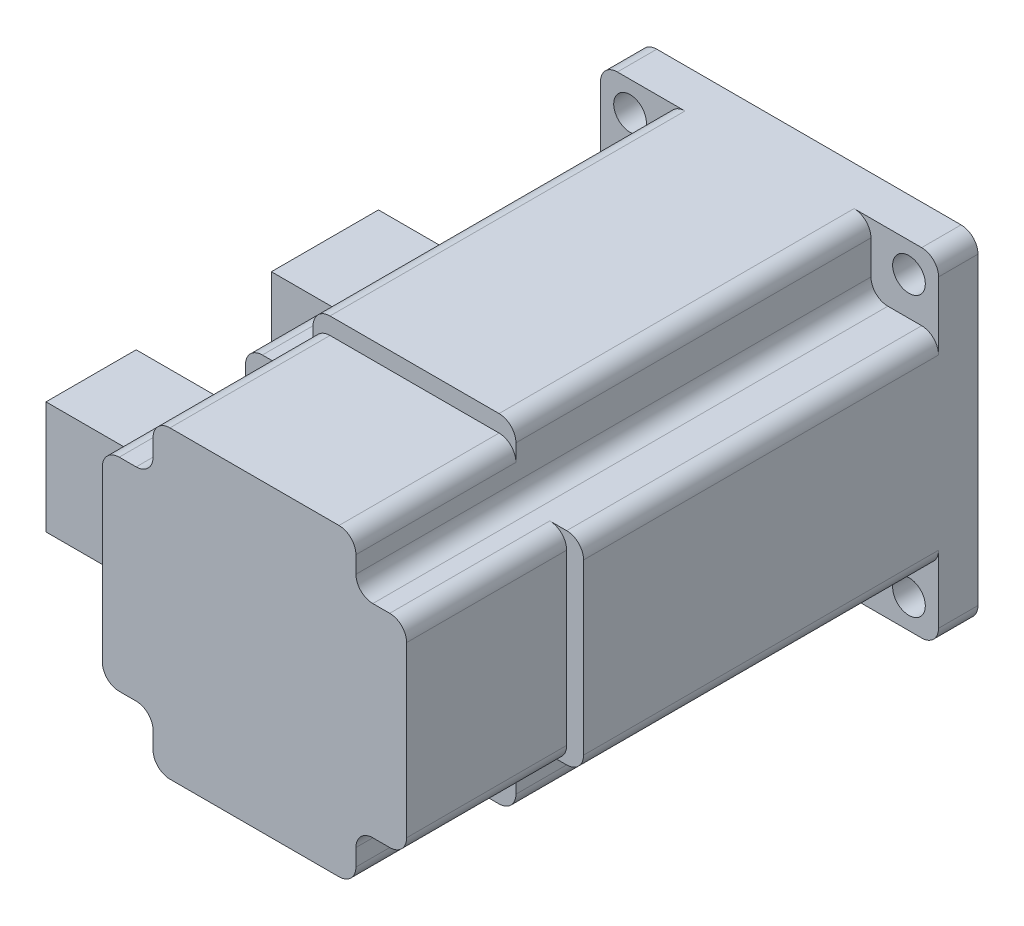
ISO-10303-21;
HEADER;
FILE_DESCRIPTION(('STEP AP214'),'2;1');
FILE_NAME('part.step','',(''),(''),'','','');
FILE_SCHEMA(('AUTOMOTIVE_DESIGN { 1 0 10303 214 1 1 1 1 }'));
ENDSEC;
DATA;
#1=APPLICATION_CONTEXT('core data for automotive mechanical design processes');
#2=APPLICATION_PROTOCOL_DEFINITION('international standard','automotive_design',2000,#1);
#3=PRODUCT_CONTEXT('',#1,'mechanical');
#4=PRODUCT('Part','Part','',(#3));
#5=PRODUCT_RELATED_PRODUCT_CATEGORY('part','',(#4));
#6=PRODUCT_DEFINITION_FORMATION('','',#4);
#7=PRODUCT_DEFINITION_CONTEXT('part definition',#1,'design');
#8=PRODUCT_DEFINITION('design','',#6,#7);
#9=PRODUCT_DEFINITION_SHAPE('','',#8);
#10=(LENGTH_UNIT() NAMED_UNIT(*) SI_UNIT(.MILLI.,.METRE.));
#11=(NAMED_UNIT(*) PLANE_ANGLE_UNIT() SI_UNIT($,.RADIAN.));
#12=(NAMED_UNIT(*) SI_UNIT($,.STERADIAN.) SOLID_ANGLE_UNIT());
#13=UNCERTAINTY_MEASURE_WITH_UNIT(LENGTH_MEASURE(1.E-05),#10,'distance_accuracy_value','');
#14=(GEOMETRIC_REPRESENTATION_CONTEXT(3) GLOBAL_UNCERTAINTY_ASSIGNED_CONTEXT((#13)) GLOBAL_UNIT_ASSIGNED_CONTEXT((#10,
#11,#12)) REPRESENTATION_CONTEXT('',''));
#15=CARTESIAN_POINT('',(0.,0.,0.));
#16=DIRECTION('',(0.,0.,1.));
#17=DIRECTION('',(1.,0.,0.));
#18=AXIS2_PLACEMENT_3D('',#15,#16,#17);
#19=CARTESIAN_POINT('',(-46.9999999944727,-9.99999999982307,81.4));
#20=DIRECTION('',(0.,0.,-1.));
#21=DIRECTION('',(-1.,0.,0.));
#22=AXIS2_PLACEMENT_3D('',#19,#20,#21);
#23=PLANE('',#22);
#24=DIRECTION('',(3.76469688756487E-12,1.,0.));
#25=VECTOR('',#24,1.);
#26=CARTESIAN_POINT('',(-29.9999999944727,-9.99999999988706,81.4));
#27=LINE('',#26,#25);
#28=CARTESIAN_POINT('',(-29.9999999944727,-9.99999999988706,81.4));
#29=VERTEX_POINT('',#28);
#30=CARTESIAN_POINT('',(-29.9999999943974,10.0000000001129,81.4));
#31=VERTEX_POINT('',#30);
#32=EDGE_CURVE('E109',#29,#31,#27,.T.);
#33=ORIENTED_EDGE('',*,*,#32,.T.);
#34=DIRECTION('',(1.,-3.76458123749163E-12,0.));
#35=VECTOR('',#34,1.);
#36=CARTESIAN_POINT('',(-46.9999999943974,10.0000000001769,81.4));
#37=LINE('',#36,#35);
#38=CARTESIAN_POINT('',(-46.9999999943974,10.0000000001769,81.4));
#39=VERTEX_POINT('',#38);
#40=EDGE_CURVE('E13',#39,#31,#37,.T.);
#41=ORIENTED_EDGE('',*,*,#40,.F.);
#42=DIRECTION('',(3.76469688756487E-12,1.,0.));
#43=VECTOR('',#42,1.);
#44=CARTESIAN_POINT('',(-46.9999999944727,-9.99999999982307,81.4));
#45=LINE('',#44,#43);
#46=CARTESIAN_POINT('',(-46.9999999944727,-9.99999999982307,81.4));
#47=VERTEX_POINT('',#46);
#48=EDGE_CURVE('E97',#47,#39,#45,.T.);
#49=ORIENTED_EDGE('',*,*,#48,.F.);
#50=DIRECTION('',(1.,-3.76458123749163E-12,0.));
#51=VECTOR('',#50,1.);
#52=CARTESIAN_POINT('',(-46.9999999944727,-9.99999999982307,81.4));
#53=LINE('',#52,#51);
#54=EDGE_CURVE('E105',#47,#29,#53,.T.);
#55=ORIENTED_EDGE('',*,*,#54,.T.);
#56=EDGE_LOOP('',(#33,#41,#49,#55));
#57=FACE_BOUND('',#56,.T.);
#58=ADVANCED_FACE('F46',(#57),#23,.F.);
#59=CARTESIAN_POINT('',(-46.9999999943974,10.0000000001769,65.4));
#60=DIRECTION('',(-3.76458123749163E-12,-1.,0.));
#61=DIRECTION('',(1.,-3.76458123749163E-12,0.));
#62=AXIS2_PLACEMENT_3D('',#59,#60,#61);
#63=PLANE('',#62);
#64=DIRECTION('',(0.,0.,-1.));
#65=VECTOR('',#64,1.);
#66=CARTESIAN_POINT('',(-29.9999999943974,10.0000000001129,65.4));
#67=LINE('',#66,#65);
#68=CARTESIAN_POINT('',(-29.9999999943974,10.0000000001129,65.4));
#69=VERTEX_POINT('',#68);
#70=EDGE_CURVE('E101',#31,#69,#67,.T.);
#71=ORIENTED_EDGE('',*,*,#70,.T.);
#72=DIRECTION('',(1.,-3.76458123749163E-12,0.));
#73=VECTOR('',#72,1.);
#74=CARTESIAN_POINT('',(-46.9999999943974,10.0000000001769,65.4));
#75=LINE('',#74,#73);
#76=CARTESIAN_POINT('',(-46.9999999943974,10.0000000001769,65.4));
#77=VERTEX_POINT('',#76);
#78=EDGE_CURVE('E54',#77,#69,#75,.T.);
#79=ORIENTED_EDGE('',*,*,#78,.F.);
#80=DIRECTION('',(0.,0.,-1.));
#81=VECTOR('',#80,1.);
#82=CARTESIAN_POINT('',(-46.9999999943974,10.0000000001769,65.4));
#83=LINE('',#82,#81);
#84=EDGE_CURVE('E92',#39,#77,#83,.T.);
#85=ORIENTED_EDGE('',*,*,#84,.F.);
#86=ORIENTED_EDGE('',*,*,#40,.T.);
#87=EDGE_LOOP('',(#71,#79,#85,#86));
#88=FACE_BOUND('',#87,.T.);
#89=ADVANCED_FACE('F100',(#88),#63,.F.);
#90=CARTESIAN_POINT('',(-46.9999999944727,-9.99999999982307,65.4));
#91=DIRECTION('',(0.,0.,1.));
#92=DIRECTION('',(1.,0.,0.));
#93=AXIS2_PLACEMENT_3D('',#90,#91,#92);
#94=PLANE('',#93);
#95=DIRECTION('',(-3.76469688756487E-12,-1.,0.));
#96=VECTOR('',#95,1.);
#97=CARTESIAN_POINT('',(-29.9999999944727,-9.99999999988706,65.4));
#98=LINE('',#97,#96);
#99=CARTESIAN_POINT('',(-29.9999999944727,-9.99999999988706,65.4));
#100=VERTEX_POINT('',#99);
#101=EDGE_CURVE('E79',#69,#100,#98,.T.);
#102=ORIENTED_EDGE('',*,*,#101,.T.);
#103=DIRECTION('',(1.,-3.76458123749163E-12,0.));
#104=VECTOR('',#103,1.);
#105=CARTESIAN_POINT('',(-46.9999999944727,-9.99999999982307,65.4));
#106=LINE('',#105,#104);
#107=CARTESIAN_POINT('',(-46.9999999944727,-9.99999999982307,65.4));
#108=VERTEX_POINT('',#107);
#109=EDGE_CURVE('E102',#108,#100,#106,.T.);
#110=ORIENTED_EDGE('',*,*,#109,.F.);
#111=DIRECTION('',(-3.76469688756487E-12,-1.,0.));
#112=VECTOR('',#111,1.);
#113=CARTESIAN_POINT('',(-46.9999999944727,-9.99999999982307,65.4));
#114=LINE('',#113,#112);
#115=EDGE_CURVE('E95',#77,#108,#114,.T.);
#116=ORIENTED_EDGE('',*,*,#115,.F.);
#117=ORIENTED_EDGE('',*,*,#78,.T.);
#118=EDGE_LOOP('',(#102,#110,#116,#117));
#119=FACE_BOUND('',#118,.T.);
#120=ADVANCED_FACE('F103',(#119),#94,.F.);
#121=CARTESIAN_POINT('',(-46.9999999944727,-9.99999999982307,65.4));
#122=DIRECTION('',(3.76458123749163E-12,1.,0.));
#123=DIRECTION('',(-1.,3.76458123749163E-12,0.));
#124=AXIS2_PLACEMENT_3D('',#121,#122,#123);
#125=PLANE('',#124);
#126=DIRECTION('',(0.,0.,1.));
#127=VECTOR('',#126,1.);
#128=CARTESIAN_POINT('',(-29.9999999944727,-9.99999999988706,65.4));
#129=LINE('',#128,#127);
#130=EDGE_CURVE('E85',#100,#29,#129,.T.);
#131=ORIENTED_EDGE('',*,*,#130,.T.);
#132=ORIENTED_EDGE('',*,*,#54,.F.);
#133=DIRECTION('',(0.,0.,1.));
#134=VECTOR('',#133,1.);
#135=CARTESIAN_POINT('',(-46.9999999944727,-9.99999999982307,65.4));
#136=LINE('',#135,#134);
#137=EDGE_CURVE('E62',#108,#47,#136,.T.);
#138=ORIENTED_EDGE('',*,*,#137,.F.);
#139=ORIENTED_EDGE('',*,*,#109,.T.);
#140=EDGE_LOOP('',(#131,#132,#138,#139));
#141=FACE_BOUND('',#140,.T.);
#142=ADVANCED_FACE('F116',(#141),#125,.F.);
#143=CARTESIAN_POINT('',(-46.9999999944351,1.76938787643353E-10,0.));
#144=DIRECTION('',(1.,-3.76469688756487E-12,0.));
#145=DIRECTION('',(3.76469688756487E-12,1.,0.));
#146=AXIS2_PLACEMENT_3D('',#143,#144,#145);
#147=PLANE('',#146);
#148=ORIENTED_EDGE('',*,*,#48,.T.);
#149=ORIENTED_EDGE('',*,*,#84,.T.);
#150=ORIENTED_EDGE('',*,*,#115,.T.);
#151=ORIENTED_EDGE('',*,*,#137,.T.);
#152=EDGE_LOOP('',(#148,#149,#150,#151));
#153=FACE_BOUND('',#152,.T.);
#154=ADVANCED_FACE('F93',(#153),#147,.F.);
#155=CARTESIAN_POINT('',(-29.9999999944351,1.12940906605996E-10,0.));
#156=DIRECTION('',(1.,-3.76469688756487E-12,0.));
#157=DIRECTION('',(3.76469688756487E-12,1.,0.));
#158=AXIS2_PLACEMENT_3D('',#155,#156,#157);
#159=PLANE('',#158);
#160=ORIENTED_EDGE('',*,*,#32,.F.);
#161=ORIENTED_EDGE('',*,*,#130,.F.);
#162=ORIENTED_EDGE('',*,*,#101,.F.);
#163=ORIENTED_EDGE('',*,*,#70,.F.);
#164=EDGE_LOOP('',(#160,#161,#162,#163));
#165=FACE_BOUND('',#164,.T.);
#166=ADVANCED_FACE('F119',(#165),#159,.T.);
#167=CLOSED_SHELL('',(#58,#89,#120,#142,#154,#166));
#168=MANIFOLD_SOLID_BREP('B2',#167);
#169=CARTESIAN_POINT('',(-29.9999999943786,15.0000000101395,91.4));
#170=DIRECTION('',(1.,-3.76458123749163E-12,0.));
#171=DIRECTION('',(3.76458123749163E-12,1.,0.));
#172=AXIS2_PLACEMENT_3D('',#169,#170,#171);
#173=PLANE('',#172);
#174=DIRECTION('',(-3.76458123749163E-12,-1.,0.));
#175=VECTOR('',#174,1.);
#176=CARTESIAN_POINT('',(-29.9999999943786,15.0000000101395,63.));
#177=LINE('',#176,#175);
#178=CARTESIAN_POINT('',(-29.9999999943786,15.0000000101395,63.));
#179=VERTEX_POINT('',#178);
#180=CARTESIAN_POINT('',(-29.9999999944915,-15.0000000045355,63.));
#181=VERTEX_POINT('',#180);
#182=EDGE_CURVE('E741',#179,#181,#177,.T.);
#183=ORIENTED_EDGE('',*,*,#182,.F.);
#184=DIRECTION('',(0.,0.,-1.));
#185=VECTOR('',#184,1.);
#186=CARTESIAN_POINT('',(-29.9999999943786,15.0000000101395,91.4));
#187=LINE('',#186,#185);
#188=CARTESIAN_POINT('',(-29.9999999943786,15.0000000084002,0.));
#189=VERTEX_POINT('',#188);
#190=EDGE_CURVE('E885',#179,#189,#187,.T.);
#191=ORIENTED_EDGE('',*,*,#190,.T.);
#192=DIRECTION('',(0.,1.,0.));
#193=VECTOR('',#192,1.);
#194=CARTESIAN_POINT('',(-29.9999999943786,-27.0000000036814,0.));
#195=LINE('',#194,#193);
#196=CARTESIAN_POINT('',(-29.9999999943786,27.0000000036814,0.));
#197=VERTEX_POINT('',#196);
#198=EDGE_CURVE('E577',#189,#197,#195,.T.);
#199=ORIENTED_EDGE('',*,*,#198,.T.);
#200=DIRECTION('',(0.,0.,1.));
#201=VECTOR('',#200,1.);
#202=CARTESIAN_POINT('',(-29.9999999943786,27.0000000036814,-7.));
#203=LINE('',#202,#201);
#204=CARTESIAN_POINT('',(-29.9999999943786,27.0000000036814,-7.));
#205=VERTEX_POINT('',#204);
#206=EDGE_CURVE('E603',#205,#197,#203,.T.);
#207=ORIENTED_EDGE('',*,*,#206,.F.);
#208=DIRECTION('',(0.,1.,0.));
#209=VECTOR('',#208,1.);
#210=CARTESIAN_POINT('',(-29.9999999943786,-27.0000000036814,-7.));
#211=LINE('',#210,#209);
#212=CARTESIAN_POINT('',(-29.9999999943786,-27.0000000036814,-7.));
#213=VERTEX_POINT('',#212);
#214=EDGE_CURVE('E558',#213,#205,#211,.T.);
#215=ORIENTED_EDGE('',*,*,#214,.F.);
#216=DIRECTION('',(0.,0.,1.));
#217=VECTOR('',#216,1.);
#218=CARTESIAN_POINT('',(-29.9999999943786,-27.0000000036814,-7.));
#219=LINE('',#218,#217);
#220=CARTESIAN_POINT('',(-29.9999999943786,-27.0000000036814,0.));
#221=VERTEX_POINT('',#220);
#222=EDGE_CURVE('E606',#213,#221,#219,.T.);
#223=ORIENTED_EDGE('',*,*,#222,.T.);
#224=CARTESIAN_POINT('',(-29.9999999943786,-15.0000000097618,0.));
#225=VERTEX_POINT('',#224);
#226=EDGE_CURVE('E578',#221,#225,#195,.T.);
#227=ORIENTED_EDGE('',*,*,#226,.T.);
#228=DIRECTION('',(0.,0.,-1.));
#229=VECTOR('',#228,1.);
#230=CARTESIAN_POINT('',(-29.9999999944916,-15.0000000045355,91.4));
#231=LINE('',#230,#229);
#232=EDGE_CURVE('E882',#181,#225,#231,.T.);
#233=ORIENTED_EDGE('',*,*,#232,.F.);
#234=EDGE_LOOP('',(#183,#191,#199,#207,#215,#223,#227,#233));
#235=FACE_BOUND('',#234,.T.);
#236=DIRECTION('',(3.76469688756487E-12,1.,0.));
#237=VECTOR('',#236,1.);
#238=CARTESIAN_POINT('',(-29.9999999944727,-9.99999999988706,41.4));
#239=LINE('',#238,#237);
#240=CARTESIAN_POINT('',(-29.9999999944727,-9.99999999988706,41.4));
#241=VERTEX_POINT('',#240);
#242=CARTESIAN_POINT('',(-29.9999999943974,10.0000000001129,41.4));
#243=VERTEX_POINT('',#242);
#244=EDGE_CURVE('E519',#241,#243,#239,.T.);
#245=ORIENTED_EDGE('',*,*,#244,.F.);
#246=DIRECTION('',(0.,0.,1.));
#247=VECTOR('',#246,1.);
#248=CARTESIAN_POINT('',(-29.9999999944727,-9.99999999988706,22.4));
#249=LINE('',#248,#247);
#250=CARTESIAN_POINT('',(-29.9999999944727,-9.99999999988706,22.4));
#251=VERTEX_POINT('',#250);
#252=EDGE_CURVE('E516',#251,#241,#249,.T.);
#253=ORIENTED_EDGE('',*,*,#252,.F.);
#254=DIRECTION('',(-3.76469688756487E-12,-1.,0.));
#255=VECTOR('',#254,1.);
#256=CARTESIAN_POINT('',(-29.9999999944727,-9.99999999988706,22.4));
#257=LINE('',#256,#255);
#258=CARTESIAN_POINT('',(-29.9999999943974,10.0000000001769,22.4));
#259=VERTEX_POINT('',#258);
#260=EDGE_CURVE('E190',#259,#251,#257,.T.);
#261=ORIENTED_EDGE('',*,*,#260,.F.);
#262=DIRECTION('',(0.,0.,-1.));
#263=VECTOR('',#262,1.);
#264=CARTESIAN_POINT('',(-29.9999999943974,10.0000000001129,22.4));
#265=LINE('',#264,#263);
#266=EDGE_CURVE('E185',#243,#259,#265,.T.);
#267=ORIENTED_EDGE('',*,*,#266,.F.);
#268=EDGE_LOOP('',(#245,#253,#261,#267));
#269=FACE_BOUND('',#268,.T.);
#270=ADVANCED_FACE('F170',(#235,#269),#173,.F.);
#271=CARTESIAN_POINT('',(23.9999999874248,-18.0000000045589,91.4));
#272=DIRECTION('',(3.7643499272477E-12,1.,0.));
#273=DIRECTION('',(-1.,3.7643499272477E-12,0.));
#274=AXIS2_PLACEMENT_3D('',#271,#272,#273);
#275=PLANE('',#274);
#276=DIRECTION('',(0.,0.,-1.));
#277=VECTOR('',#276,1.);
#278=CARTESIAN_POINT('',(21.0000000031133,-18.0000000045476,91.4));
#279=LINE('',#278,#277);
#280=CARTESIAN_POINT('',(21.0000000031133,-18.0000000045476,91.4));
#281=VERTEX_POINT('',#280);
#282=CARTESIAN_POINT('',(21.0000000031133,-18.0000000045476,0.));
#283=VERTEX_POINT('',#282);
#284=EDGE_CURVE('E797',#281,#283,#279,.T.);
#285=ORIENTED_EDGE('',*,*,#284,.T.);
#286=DIRECTION('',(1.,-3.7643499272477E-12,0.));
#287=VECTOR('',#286,1.);
#288=CARTESIAN_POINT('',(23.9999999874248,-18.0000000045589,0.));
#289=LINE('',#288,#287);
#290=CARTESIAN_POINT('',(26.9999999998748,-18.0000000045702,0.));
#291=VERTEX_POINT('',#290);
#292=EDGE_CURVE('E767',#283,#291,#289,.T.);
#293=ORIENTED_EDGE('',*,*,#292,.T.);
#294=DIRECTION('',(0.,0.,-1.));
#295=VECTOR('',#294,1.);
#296=CARTESIAN_POINT('',(26.9999999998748,-18.0000000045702,91.4));
#297=LINE('',#296,#295);
#298=CARTESIAN_POINT('',(26.9999999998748,-18.0000000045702,63.));
#299=VERTEX_POINT('',#298);
#300=EDGE_CURVE('E44',#299,#291,#297,.T.);
#301=ORIENTED_EDGE('',*,*,#300,.F.);
#302=DIRECTION('',(1.,-3.7643499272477E-12,0.));
#303=VECTOR('',#302,1.);
#304=CARTESIAN_POINT('',(23.9999999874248,-18.0000000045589,63.));
#305=LINE('',#304,#303);
#306=CARTESIAN_POINT('',(23.9999999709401,-18.0000000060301,63.));
#307=VERTEX_POINT('',#306);
#308=EDGE_CURVE('E765',#307,#299,#305,.T.);
#309=ORIENTED_EDGE('',*,*,#308,.F.);
#310=DIRECTION('',(0.,0.,1.));
#311=VECTOR('',#310,1.);
#312=CARTESIAN_POINT('',(23.9999999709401,-18.0000000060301,63.));
#313=LINE('',#312,#311);
#314=CARTESIAN_POINT('',(23.9999999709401,-18.0000000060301,91.4));
#315=VERTEX_POINT('',#314);
#316=EDGE_CURVE('E719',#307,#315,#313,.T.);
#317=ORIENTED_EDGE('',*,*,#316,.T.);
#318=DIRECTION('',(1.,-3.76434996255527E-12,0.));
#319=VECTOR('',#318,1.);
#320=CARTESIAN_POINT('',(21.0000000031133,-18.0000000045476,91.4));
#321=LINE('',#320,#319);
#322=EDGE_CURVE('E768',#281,#315,#321,.T.);
#323=ORIENTED_EDGE('',*,*,#322,.F.);
#324=EDGE_LOOP('',(#285,#293,#301,#309,#317,#323));
#325=FACE_BOUND('',#324,.T.);
#326=ADVANCED_FACE('F172',(#325),#275,.F.);
#327=CARTESIAN_POINT('',(27.0000000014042,-15.0000000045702,91.4));
#328=DIRECTION('',(0.,0.,-1.));
#329=DIRECTION('',(-1.,0.,0.));
#330=AXIS2_PLACEMENT_3D('',#327,#328,#329);
#331=CYLINDRICAL_SURFACE('',#330,3.);
#332=CARTESIAN_POINT('',(27.0000000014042,-15.0000000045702,63.));
#333=DIRECTION('',(0.,0.,1.));
#334=DIRECTION('',(1.,0.,0.));
#335=AXIS2_PLACEMENT_3D('',#332,#333,#334);
#336=CIRCLE('',#335,3.);
#337=CARTESIAN_POINT('',(30.0000000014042,-15.0000000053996,63.));
#338=VERTEX_POINT('',#337);
#339=EDGE_CURVE('E763',#299,#338,#336,.T.);
#340=ORIENTED_EDGE('',*,*,#339,.F.);
#341=ORIENTED_EDGE('',*,*,#300,.T.);
#342=CARTESIAN_POINT('',(27.0000000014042,-15.0000000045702,0.));
#343=DIRECTION('',(0.,0.,1.));
#344=DIRECTION('',(1.,0.,0.));
#345=AXIS2_PLACEMENT_3D('',#342,#343,#344);
#346=CIRCLE('',#345,3.);
#347=CARTESIAN_POINT('',(30.0000000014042,-15.0000000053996,0.));
#348=VERTEX_POINT('',#347);
#349=EDGE_CURVE('E800',#291,#348,#346,.T.);
#350=ORIENTED_EDGE('',*,*,#349,.T.);
#351=DIRECTION('',(0.,0.,-1.));
#352=VECTOR('',#351,1.);
#353=CARTESIAN_POINT('',(30.0000000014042,-15.0000000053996,91.4));
#354=LINE('',#353,#352);
#355=EDGE_CURVE('E178',#338,#348,#354,.T.);
#356=ORIENTED_EDGE('',*,*,#355,.F.);
#357=EDGE_LOOP('',(#340,#341,#350,#356));
#358=FACE_BOUND('',#357,.T.);
#359=ADVANCED_FACE('F929',(#358),#331,.T.);
#360=CARTESIAN_POINT('',(30.0000000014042,-15.0000000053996,91.4));
#361=DIRECTION('',(-1.,3.76458123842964E-12,0.));
#362=DIRECTION('',(-3.76458123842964E-12,-1.,0.));
#363=AXIS2_PLACEMENT_3D('',#360,#361,#362);
#364=PLANE('',#363);
#365=DIRECTION('',(3.76458123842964E-12,1.,0.));
#366=VECTOR('',#365,1.);
#367=CARTESIAN_POINT('',(30.0000000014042,-15.0000000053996,63.));
#368=LINE('',#367,#366);
#369=CARTESIAN_POINT('',(30.0000000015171,14.9999999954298,63.));
#370=VERTEX_POINT('',#369);
#371=EDGE_CURVE('E761',#338,#370,#368,.T.);
#372=ORIENTED_EDGE('',*,*,#371,.F.);
#373=ORIENTED_EDGE('',*,*,#355,.T.);
#374=DIRECTION('',(0.,-1.,0.));
#375=VECTOR('',#374,1.);
#376=CARTESIAN_POINT('',(29.9999999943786,-27.0000000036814,0.));
#377=LINE('',#376,#375);
#378=CARTESIAN_POINT('',(29.9999999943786,-27.0000000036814,0.));
#379=VERTEX_POINT('',#378);
#380=EDGE_CURVE('E589',#348,#379,#377,.T.);
#381=ORIENTED_EDGE('',*,*,#380,.T.);
#382=DIRECTION('',(0.,0.,1.));
#383=VECTOR('',#382,1.);
#384=CARTESIAN_POINT('',(29.9999999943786,-27.0000000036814,-7.));
#385=LINE('',#384,#383);
#386=CARTESIAN_POINT('',(29.9999999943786,-27.0000000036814,-7.));
#387=VERTEX_POINT('',#386);
#388=EDGE_CURVE('E568',#387,#379,#385,.T.);
#389=ORIENTED_EDGE('',*,*,#388,.F.);
#390=DIRECTION('',(0.,-1.,0.));
#391=VECTOR('',#390,1.);
#392=CARTESIAN_POINT('',(29.9999999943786,-27.0000000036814,-7.));
#393=LINE('',#392,#391);
#394=CARTESIAN_POINT('',(29.9999999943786,27.0000000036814,-7.));
#395=VERTEX_POINT('',#394);
#396=EDGE_CURVE('E566',#395,#387,#393,.T.);
#397=ORIENTED_EDGE('',*,*,#396,.F.);
#398=DIRECTION('',(0.,0.,1.));
#399=VECTOR('',#398,1.);
#400=CARTESIAN_POINT('',(29.9999999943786,27.0000000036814,-7.));
#401=LINE('',#400,#399);
#402=CARTESIAN_POINT('',(29.9999999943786,27.0000000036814,0.));
#403=VERTEX_POINT('',#402);
#404=EDGE_CURVE('E594',#395,#403,#401,.T.);
#405=ORIENTED_EDGE('',*,*,#404,.T.);
#406=CARTESIAN_POINT('',(29.9999999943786,14.9999999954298,0.));
#407=VERTEX_POINT('',#406);
#408=EDGE_CURVE('E554',#403,#407,#377,.T.);
#409=ORIENTED_EDGE('',*,*,#408,.T.);
#410=DIRECTION('',(0.,0.,-1.));
#411=VECTOR('',#410,1.);
#412=CARTESIAN_POINT('',(30.0000000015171,15.0000000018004,91.4));
#413=LINE('',#412,#411);
#414=EDGE_CURVE('E918',#370,#407,#413,.T.);
#415=ORIENTED_EDGE('',*,*,#414,.F.);
#416=EDGE_LOOP('',(#372,#373,#381,#389,#397,#405,#409,#415));
#417=FACE_BOUND('',#416,.T.);
#418=ADVANCED_FACE('F924',(#417),#364,.F.);
#419=CARTESIAN_POINT('',(27.0000000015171,14.9999999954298,91.4));
#420=DIRECTION('',(0.,0.,-1.));
#421=DIRECTION('',(-1.,0.,0.));
#422=AXIS2_PLACEMENT_3D('',#419,#420,#421);
#423=CYLINDRICAL_SURFACE('',#422,3.);
#424=CARTESIAN_POINT('',(27.0000000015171,14.9999999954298,63.));
#425=DIRECTION('',(0.,0.,1.));
#426=DIRECTION('',(1.,0.,0.));
#427=AXIS2_PLACEMENT_3D('',#424,#425,#426);
#428=CIRCLE('',#427,3.);
#429=CARTESIAN_POINT('',(27.0000000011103,17.9999999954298,63.));
#430=VERTEX_POINT('',#429);
#431=EDGE_CURVE('E759',#370,#430,#428,.T.);
#432=ORIENTED_EDGE('',*,*,#431,.F.);
#433=ORIENTED_EDGE('',*,*,#414,.T.);
#434=CARTESIAN_POINT('',(27.0000000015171,14.9999999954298,0.));
#435=DIRECTION('',(0.,0.,1.));
#436=DIRECTION('',(1.,0.,0.));
#437=AXIS2_PLACEMENT_3D('',#434,#435,#436);
#438=CIRCLE('',#437,3.);
#439=CARTESIAN_POINT('',(27.0000000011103,17.9999999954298,0.));
#440=VERTEX_POINT('',#439);
#441=EDGE_CURVE('E803',#407,#440,#438,.T.);
#442=ORIENTED_EDGE('',*,*,#441,.T.);
#443=DIRECTION('',(0.,0.,-1.));
#444=VECTOR('',#443,1.);
#445=CARTESIAN_POINT('',(27.0000000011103,17.9999999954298,91.4));
#446=LINE('',#445,#444);
#447=EDGE_CURVE('E915',#430,#440,#446,.T.);
#448=ORIENTED_EDGE('',*,*,#447,.F.);
#449=EDGE_LOOP('',(#432,#433,#442,#448));
#450=FACE_BOUND('',#449,.T.);
#451=ADVANCED_FACE('F953',(#450),#423,.T.);
#452=CARTESIAN_POINT('',(18.0000000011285,23.999999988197,91.4));
#453=DIRECTION('',(-1.,3.76550640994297E-12,0.));
#454=DIRECTION('',(-3.76550640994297E-12,-1.,0.));
#455=AXIS2_PLACEMENT_3D('',#452,#453,#454);
#456=PLANE('',#455);
#457=DIRECTION('',(0.,0.,-1.));
#458=VECTOR('',#457,1.);
#459=CARTESIAN_POINT('',(18.0000000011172,21.0000000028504,91.4));
#460=LINE('',#459,#458);
#461=CARTESIAN_POINT('',(18.0000000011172,21.0000000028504,91.4));
#462=VERTEX_POINT('',#461);
#463=CARTESIAN_POINT('',(18.0000000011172,21.0000000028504,0.));
#464=VERTEX_POINT('',#463);
#465=EDGE_CURVE('E909',#462,#464,#460,.T.);
#466=ORIENTED_EDGE('',*,*,#465,.T.);
#467=DIRECTION('',(3.76550640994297E-12,1.,0.));
#468=VECTOR('',#467,1.);
#469=CARTESIAN_POINT('',(18.0000000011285,23.999999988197,0.));
#470=LINE('',#469,#468);
#471=CARTESIAN_POINT('',(18.0000000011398,27.000000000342,0.));
#472=VERTEX_POINT('',#471);
#473=EDGE_CURVE('E812',#464,#472,#470,.T.);
#474=ORIENTED_EDGE('',*,*,#473,.T.);
#475=DIRECTION('',(0.,0.,-1.));
#476=VECTOR('',#475,1.);
#477=CARTESIAN_POINT('',(18.0000000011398,27.000000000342,91.4));
#478=LINE('',#477,#476);
#479=CARTESIAN_POINT('',(18.0000000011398,27.0000000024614,63.));
#480=VERTEX_POINT('',#479);
#481=EDGE_CURVE('E906',#480,#472,#478,.T.);
#482=ORIENTED_EDGE('',*,*,#481,.F.);
#483=DIRECTION('',(3.76550640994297E-12,1.,0.));
#484=VECTOR('',#483,1.);
#485=CARTESIAN_POINT('',(18.0000000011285,23.999999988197,63.));
#486=LINE('',#485,#484);
#487=CARTESIAN_POINT('',(17.9999999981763,23.9999999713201,63.));
#488=VERTEX_POINT('',#487);
#489=EDGE_CURVE('E755',#488,#480,#486,.T.);
#490=ORIENTED_EDGE('',*,*,#489,.F.);
#491=DIRECTION('',(0.,0.,1.));
#492=VECTOR('',#491,1.);
#493=CARTESIAN_POINT('',(17.9999999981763,23.9999999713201,63.));
#494=LINE('',#493,#492);
#495=CARTESIAN_POINT('',(17.9999999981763,23.9999999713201,91.4));
#496=VERTEX_POINT('',#495);
#497=EDGE_CURVE('E709',#488,#496,#494,.T.);
#498=ORIENTED_EDGE('',*,*,#497,.T.);
#499=DIRECTION('',(3.76319347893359E-12,1.,0.));
#500=VECTOR('',#499,1.);
#501=CARTESIAN_POINT('',(18.0000000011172,21.0000000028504,91.4));
#502=LINE('',#501,#500);
#503=EDGE_CURVE('E776',#462,#496,#502,.T.);
#504=ORIENTED_EDGE('',*,*,#503,.F.);
#505=EDGE_LOOP('',(#466,#474,#482,#490,#498,#504));
#506=FACE_BOUND('',#505,.T.);
#507=ADVANCED_FACE('F1025',(#506),#456,.F.);
#508=CARTESIAN_POINT('',(14.9999999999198,27.0000000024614,91.4));
#509=DIRECTION('',(0.,0.,-1.));
#510=DIRECTION('',(-1.,0.,0.));
#511=AXIS2_PLACEMENT_3D('',#508,#509,#510);
#512=CYLINDRICAL_SURFACE('',#511,3.00000000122);
#513=CARTESIAN_POINT('',(14.9999999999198,27.0000000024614,63.));
#514=DIRECTION('',(0.,0.,1.));
#515=DIRECTION('',(1.,0.,0.));
#516=AXIS2_PLACEMENT_3D('',#513,#514,#515);
#517=CIRCLE('',#516,3.00000000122);
#518=CARTESIAN_POINT('',(15.000000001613,30.0000000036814,63.));
#519=VERTEX_POINT('',#518);
#520=EDGE_CURVE('E753',#480,#519,#517,.T.);
#521=ORIENTED_EDGE('',*,*,#520,.F.);
#522=ORIENTED_EDGE('',*,*,#481,.T.);
#523=CARTESIAN_POINT('',(14.9999999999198,27.0000000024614,0.));
#524=DIRECTION('',(0.,0.,1.));
#525=DIRECTION('',(1.,0.,0.));
#526=AXIS2_PLACEMENT_3D('',#523,#524,#525);
#527=CIRCLE('',#526,3.00000000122);
#528=CARTESIAN_POINT('',(14.9999999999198,30.0000000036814,0.));
#529=VERTEX_POINT('',#528);
#530=EDGE_CURVE('E815',#472,#529,#527,.T.);
#531=ORIENTED_EDGE('',*,*,#530,.T.);
#532=DIRECTION('',(0.,0.,-1.));
#533=VECTOR('',#532,1.);
#534=CARTESIAN_POINT('',(15.000000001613,30.0000000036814,91.4));
#535=LINE('',#534,#533);
#536=EDGE_CURVE('E903',#519,#529,#535,.T.);
#537=ORIENTED_EDGE('',*,*,#536,.F.);
#538=EDGE_LOOP('',(#521,#522,#531,#537));
#539=FACE_BOUND('',#538,.T.);
#540=ADVANCED_FACE('F1020',(#539),#512,.T.);
#541=CARTESIAN_POINT('',(15.000000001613,30.0000000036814,91.4));
#542=DIRECTION('',(-3.76458123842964E-12,-1.,0.));
#543=DIRECTION('',(1.,-3.76458123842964E-12,0.));
#544=AXIS2_PLACEMENT_3D('',#541,#542,#543);
#545=PLANE('',#544);
#546=DIRECTION('',(-1.,3.76458123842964E-12,0.));
#547=VECTOR('',#546,1.);
#548=CARTESIAN_POINT('',(15.000000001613,30.0000000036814,63.));
#549=LINE('',#548,#547);
#550=CARTESIAN_POINT('',(-15.000000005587,30.0000000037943,63.));
#551=VERTEX_POINT('',#550);
#552=EDGE_CURVE('E751',#519,#551,#549,.T.);
#553=ORIENTED_EDGE('',*,*,#552,.F.);
#554=ORIENTED_EDGE('',*,*,#536,.T.);
#555=DIRECTION('',(1.,0.,0.));
#556=VECTOR('',#555,1.);
#557=CARTESIAN_POINT('',(26.9999999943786,30.0000000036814,0.));
#558=LINE('',#557,#556);
#559=CARTESIAN_POINT('',(26.9999999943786,30.0000000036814,0.));
#560=VERTEX_POINT('',#559);
#561=EDGE_CURVE('E583',#529,#560,#558,.T.);
#562=ORIENTED_EDGE('',*,*,#561,.T.);
#563=DIRECTION('',(0.,0.,1.));
#564=VECTOR('',#563,1.);
#565=CARTESIAN_POINT('',(26.9999999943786,30.0000000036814,-7.));
#566=LINE('',#565,#564);
#567=CARTESIAN_POINT('',(26.9999999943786,30.0000000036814,-7.));
#568=VERTEX_POINT('',#567);
#569=EDGE_CURVE('E597',#568,#560,#566,.T.);
#570=ORIENTED_EDGE('',*,*,#569,.F.);
#571=DIRECTION('',(1.,0.,0.));
#572=VECTOR('',#571,1.);
#573=CARTESIAN_POINT('',(26.9999999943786,30.0000000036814,-7.));
#574=LINE('',#573,#572);
#575=CARTESIAN_POINT('',(-26.9999999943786,30.0000000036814,-7.));
#576=VERTEX_POINT('',#575);
#577=EDGE_CURVE('E562',#576,#568,#574,.T.);
#578=ORIENTED_EDGE('',*,*,#577,.F.);
#579=DIRECTION('',(0.,0.,1.));
#580=VECTOR('',#579,1.);
#581=CARTESIAN_POINT('',(-26.9999999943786,30.0000000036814,-7.));
#582=LINE('',#581,#580);
#583=CARTESIAN_POINT('',(-26.9999999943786,30.0000000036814,0.));
#584=VERTEX_POINT('',#583);
#585=EDGE_CURVE('E600',#576,#584,#582,.T.);
#586=ORIENTED_EDGE('',*,*,#585,.T.);
#587=CARTESIAN_POINT('',(-15.0000000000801,30.0000000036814,0.));
#588=VERTEX_POINT('',#587);
#589=EDGE_CURVE('E584',#584,#588,#558,.T.);
#590=ORIENTED_EDGE('',*,*,#589,.T.);
#591=DIRECTION('',(0.,0.,-1.));
#592=VECTOR('',#591,1.);
#593=CARTESIAN_POINT('',(-15.000000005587,30.0000000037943,91.4));
#594=LINE('',#593,#592);
#595=EDGE_CURVE('E900',#551,#588,#594,.T.);
#596=ORIENTED_EDGE('',*,*,#595,.F.);
#597=EDGE_LOOP('',(#553,#554,#562,#570,#578,#586,#590,#596));
#598=FACE_BOUND('',#597,.T.);
#599=ADVANCED_FACE('F1015',(#598),#545,.F.);
#600=CARTESIAN_POINT('',(-15.0000000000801,27.0000000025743,91.4));
#601=DIRECTION('',(0.,0.,-1.));
#602=DIRECTION('',(-1.,0.,0.));
#603=AXIS2_PLACEMENT_3D('',#600,#601,#602);
#604=CYLINDRICAL_SURFACE('',#603,3.00000000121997);
#605=CARTESIAN_POINT('',(-15.0000000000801,27.0000000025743,63.));
#606=DIRECTION('',(0.,0.,1.));
#607=DIRECTION('',(1.,0.,0.));
#608=AXIS2_PLACEMENT_3D('',#605,#606,#607);
#609=CIRCLE('',#608,3.00000000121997);
#610=CARTESIAN_POINT('',(-18.0000000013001,27.0000000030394,63.));
#611=VERTEX_POINT('',#610);
#612=EDGE_CURVE('E749',#551,#611,#609,.T.);
#613=ORIENTED_EDGE('',*,*,#612,.F.);
#614=ORIENTED_EDGE('',*,*,#595,.T.);
#615=CARTESIAN_POINT('',(-15.0000000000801,27.0000000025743,0.));
#616=DIRECTION('',(0.,0.,1.));
#617=DIRECTION('',(1.,0.,0.));
#618=AXIS2_PLACEMENT_3D('',#615,#616,#617);
#619=CIRCLE('',#618,3.00000000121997);
#620=CARTESIAN_POINT('',(-18.0000000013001,27.0000000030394,0.));
#621=VERTEX_POINT('',#620);
#622=EDGE_CURVE('E818',#588,#621,#619,.T.);
#623=ORIENTED_EDGE('',*,*,#622,.T.);
#624=DIRECTION('',(0.,0.,-1.));
#625=VECTOR('',#624,1.);
#626=CARTESIAN_POINT('',(-18.0000000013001,27.0000000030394,91.4));
#627=LINE('',#626,#625);
#628=EDGE_CURVE('E897',#611,#621,#627,.T.);
#629=ORIENTED_EDGE('',*,*,#628,.F.);
#630=EDGE_LOOP('',(#613,#614,#623,#629));
#631=FACE_BOUND('',#630,.T.);
#632=ADVANCED_FACE('F1122',(#631),#604,.T.);
#633=CARTESIAN_POINT('',(-23.9999999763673,18.0000000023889,91.4));
#634=DIRECTION('',(-3.76434991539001E-12,-1.,0.));
#635=DIRECTION('',(1.,-3.76434991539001E-12,0.));
#636=AXIS2_PLACEMENT_3D('',#633,#634,#635);
#637=PLANE('',#636);
#638=DIRECTION('',(0.,0.,-1.));
#639=VECTOR('',#638,1.);
#640=CARTESIAN_POINT('',(-21.0000000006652,18.0000000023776,91.4));
#641=LINE('',#640,#639);
#642=CARTESIAN_POINT('',(-21.0000000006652,18.0000000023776,91.4));
#643=VERTEX_POINT('',#642);
#644=CARTESIAN_POINT('',(-21.0000000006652,18.0000000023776,0.));
#645=VERTEX_POINT('',#644);
#646=EDGE_CURVE('E891',#643,#645,#641,.T.);
#647=ORIENTED_EDGE('',*,*,#646,.T.);
#648=DIRECTION('',(-1.,3.76434991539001E-12,0.));
#649=VECTOR('',#648,1.);
#650=CARTESIAN_POINT('',(-23.9999999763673,18.0000000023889,0.));
#651=LINE('',#650,#649);
#652=CARTESIAN_POINT('',(-26.9999999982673,18.0000000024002,0.));
#653=VERTEX_POINT('',#652);
#654=EDGE_CURVE('E827',#645,#653,#651,.T.);
#655=ORIENTED_EDGE('',*,*,#654,.T.);
#656=DIRECTION('',(0.,0.,-1.));
#657=VECTOR('',#656,1.);
#658=CARTESIAN_POINT('',(-26.9999999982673,18.0000000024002,91.4));
#659=LINE('',#658,#657);
#660=CARTESIAN_POINT('',(-26.9999999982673,18.0000000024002,63.));
#661=VERTEX_POINT('',#660);
#662=EDGE_CURVE('E888',#661,#653,#659,.T.);
#663=ORIENTED_EDGE('',*,*,#662,.F.);
#664=DIRECTION('',(-1.,3.76434991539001E-12,0.));
#665=VECTOR('',#664,1.);
#666=CARTESIAN_POINT('',(-23.9999999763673,18.0000000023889,63.));
#667=LINE('',#666,#665);
#668=CARTESIAN_POINT('',(-23.9999999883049,17.9999999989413,63.));
#669=VERTEX_POINT('',#668);
#670=EDGE_CURVE('E745',#669,#661,#667,.T.);
#671=ORIENTED_EDGE('',*,*,#670,.F.);
#672=DIRECTION('',(0.,0.,1.));
#673=VECTOR('',#672,1.);
#674=CARTESIAN_POINT('',(-23.9999999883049,17.9999999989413,63.));
#675=LINE('',#674,#673);
#676=CARTESIAN_POINT('',(-23.9999999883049,17.9999999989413,91.4));
#677=VERTEX_POINT('',#676);
#678=EDGE_CURVE('E699',#669,#677,#675,.T.);
#679=ORIENTED_EDGE('',*,*,#678,.T.);
#680=DIRECTION('',(-1.,3.76434997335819E-12,0.));
#681=VECTOR('',#680,1.);
#682=CARTESIAN_POINT('',(-23.9999999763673,18.0000000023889,91.4));
#683=LINE('',#682,#681);
#684=EDGE_CURVE('E783',#643,#677,#683,.T.);
#685=ORIENTED_EDGE('',*,*,#684,.F.);
#686=EDGE_LOOP('',(#647,#655,#663,#671,#679,#685));
#687=FACE_BOUND('',#686,.T.);
#688=ADVANCED_FACE('F1054',(#687),#637,.F.);
#689=CARTESIAN_POINT('',(-27.0000000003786,15.0000000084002,91.4));
#690=DIRECTION('',(0.,0.,-1.));
#691=DIRECTION('',(-1.,0.,0.));
#692=AXIS2_PLACEMENT_3D('',#689,#690,#691);
#693=CYLINDRICAL_SURFACE('',#692,2.99999999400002);
#694=CARTESIAN_POINT('',(-27.0000000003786,15.0000000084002,63.));
#695=DIRECTION('',(0.,0.,1.));
#696=DIRECTION('',(1.,0.,0.));
#697=AXIS2_PLACEMENT_3D('',#694,#695,#696);
#698=CIRCLE('',#697,2.99999999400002);
#699=EDGE_CURVE('E743',#661,#179,#698,.T.);
#700=ORIENTED_EDGE('',*,*,#699,.F.);
#701=ORIENTED_EDGE('',*,*,#662,.T.);
#702=CARTESIAN_POINT('',(-27.0000000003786,15.0000000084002,0.));
#703=DIRECTION('',(0.,0.,1.));
#704=DIRECTION('',(1.,0.,0.));
#705=AXIS2_PLACEMENT_3D('',#702,#703,#704);
#706=CIRCLE('',#705,2.99999999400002);
#707=EDGE_CURVE('E830',#653,#189,#706,.T.);
#708=ORIENTED_EDGE('',*,*,#707,.T.);
#709=ORIENTED_EDGE('',*,*,#190,.F.);
#710=EDGE_LOOP('',(#700,#701,#708,#709));
#711=FACE_BOUND('',#710,.T.);
#712=ADVANCED_FACE('F1116',(#711),#693,.T.);
#713=CARTESIAN_POINT('',(-27.0000000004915,-15.0000000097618,91.4));
#714=DIRECTION('',(0.,0.,-1.));
#715=DIRECTION('',(-1.,0.,0.));
#716=AXIS2_PLACEMENT_3D('',#713,#714,#715);
#717=CYLINDRICAL_SURFACE('',#716,2.99999999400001);
#718=CARTESIAN_POINT('',(-27.0000000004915,-15.0000000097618,63.));
#719=DIRECTION('',(0.,0.,1.));
#720=DIRECTION('',(1.,0.,0.));
#721=AXIS2_PLACEMENT_3D('',#718,#719,#720);
#722=CIRCLE('',#721,2.99999999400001);
#723=CARTESIAN_POINT('',(-27.0000000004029,-18.0000000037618,63.));
#724=VERTEX_POINT('',#723);
#725=EDGE_CURVE('E739',#181,#724,#722,.T.);
#726=ORIENTED_EDGE('',*,*,#725,.F.);
#727=ORIENTED_EDGE('',*,*,#232,.T.);
#728=CARTESIAN_POINT('',(-27.0000000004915,-15.0000000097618,0.));
#729=DIRECTION('',(0.,0.,1.));
#730=DIRECTION('',(1.,0.,0.));
#731=AXIS2_PLACEMENT_3D('',#728,#729,#730);
#732=CIRCLE('',#731,2.99999999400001);
#733=CARTESIAN_POINT('',(-27.0000000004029,-18.0000000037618,0.));
#734=VERTEX_POINT('',#733);
#735=EDGE_CURVE('E833',#225,#734,#732,.T.);
#736=ORIENTED_EDGE('',*,*,#735,.T.);
#737=DIRECTION('',(0.,0.,-1.));
#738=VECTOR('',#737,1.);
#739=CARTESIAN_POINT('',(-27.0000000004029,-18.0000000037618,91.4));
#740=LINE('',#739,#738);
#741=EDGE_CURVE('E879',#724,#734,#740,.T.);
#742=ORIENTED_EDGE('',*,*,#741,.F.);
#743=EDGE_LOOP('',(#726,#727,#736,#742));
#744=FACE_BOUND('',#743,.T.);
#745=ADVANCED_FACE('F1114',(#744),#717,.T.);
#746=CARTESIAN_POINT('',(-18.000000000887,-24.0000000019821,91.4));
#747=DIRECTION('',(1.,-3.7643499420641E-12,0.));
#748=DIRECTION('',(3.7643499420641E-12,1.,0.));
#749=AXIS2_PLACEMENT_3D('',#746,#747,#748);
#750=PLANE('',#749);
#751=DIRECTION('',(0.,0.,-1.));
#752=VECTOR('',#751,1.);
#753=CARTESIAN_POINT('',(-18.0000000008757,-21.0000000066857,91.4));
#754=LINE('',#753,#752);
#755=CARTESIAN_POINT('',(-18.0000000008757,-21.0000000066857,91.4));
#756=VERTEX_POINT('',#755);
#757=CARTESIAN_POINT('',(-18.0000000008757,-21.0000000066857,0.));
#758=VERTEX_POINT('',#757);
#759=EDGE_CURVE('E873',#756,#758,#754,.T.);
#760=ORIENTED_EDGE('',*,*,#759,.T.);
#761=DIRECTION('',(-3.7643499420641E-12,-1.,0.));
#762=VECTOR('',#761,1.);
#763=CARTESIAN_POINT('',(-18.000000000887,-24.0000000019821,0.));
#764=LINE('',#763,#762);
#765=CARTESIAN_POINT('',(-18.0000000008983,-27.0000000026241,0.));
#766=VERTEX_POINT('',#765);
#767=EDGE_CURVE('E842',#758,#766,#764,.T.);
#768=ORIENTED_EDGE('',*,*,#767,.T.);
#769=DIRECTION('',(0.,0.,-1.));
#770=VECTOR('',#769,1.);
#771=CARTESIAN_POINT('',(-18.0000000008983,-27.0000000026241,91.4));
#772=LINE('',#771,#770);
#773=CARTESIAN_POINT('',(-18.0000000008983,-27.0000000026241,63.));
#774=VERTEX_POINT('',#773);
#775=EDGE_CURVE('E870',#774,#766,#772,.T.);
#776=ORIENTED_EDGE('',*,*,#775,.F.);
#777=DIRECTION('',(-3.7643499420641E-12,-1.,0.));
#778=VECTOR('',#777,1.);
#779=CARTESIAN_POINT('',(-18.000000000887,-24.0000000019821,63.));
#780=LINE('',#779,#778);
#781=CARTESIAN_POINT('',(-18.0000000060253,-23.9999999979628,63.));
#782=VERTEX_POINT('',#781);
#783=EDGE_CURVE('E735',#782,#774,#780,.T.);
#784=ORIENTED_EDGE('',*,*,#783,.F.);
#785=DIRECTION('',(0.,0.,1.));
#786=VECTOR('',#785,1.);
#787=CARTESIAN_POINT('',(-18.0000000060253,-23.9999999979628,63.));
#788=LINE('',#787,#786);
#789=CARTESIAN_POINT('',(-18.0000000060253,-23.9999999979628,91.4));
#790=VERTEX_POINT('',#789);
#791=EDGE_CURVE('E688',#782,#790,#788,.T.);
#792=ORIENTED_EDGE('',*,*,#791,.T.);
#793=DIRECTION('',(-3.76434994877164E-12,-1.,0.));
#794=VECTOR('',#793,1.);
#795=CARTESIAN_POINT('',(-18.000000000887,-24.0000000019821,91.4));
#796=LINE('',#795,#794);
#797=EDGE_CURVE('E790',#756,#790,#796,.T.);
#798=ORIENTED_EDGE('',*,*,#797,.F.);
#799=EDGE_LOOP('',(#760,#768,#776,#784,#792,#798));
#800=FACE_BOUND('',#799,.T.);
#801=ADVANCED_FACE('F1081',(#800),#750,.F.);
#802=CARTESIAN_POINT('',(-15.0000000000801,-27.0000000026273,91.4));
#803=DIRECTION('',(0.,0.,-1.));
#804=DIRECTION('',(-1.,0.,0.));
#805=AXIS2_PLACEMENT_3D('',#802,#803,#804);
#806=CYLINDRICAL_SURFACE('',#805,3.00000000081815);
#807=CARTESIAN_POINT('',(-15.0000000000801,-27.0000000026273,63.));
#808=DIRECTION('',(0.,0.,1.));
#809=DIRECTION('',(1.,0.,0.));
#810=AXIS2_PLACEMENT_3D('',#807,#808,#809);
#811=CIRCLE('',#810,3.00000000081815);
#812=CARTESIAN_POINT('',(-15.0000000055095,-30.0000000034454,63.));
#813=VERTEX_POINT('',#812);
#814=EDGE_CURVE('E733',#774,#813,#811,.T.);
#815=ORIENTED_EDGE('',*,*,#814,.F.);
#816=ORIENTED_EDGE('',*,*,#775,.T.);
#817=CARTESIAN_POINT('',(-15.0000000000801,-27.0000000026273,0.));
#818=DIRECTION('',(0.,0.,1.));
#819=DIRECTION('',(1.,0.,0.));
#820=AXIS2_PLACEMENT_3D('',#817,#818,#819);
#821=CIRCLE('',#820,3.00000000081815);
#822=CARTESIAN_POINT('',(-15.0000000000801,-30.0000000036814,0.));
#823=VERTEX_POINT('',#822);
#824=EDGE_CURVE('E845',#766,#823,#821,.T.);
#825=ORIENTED_EDGE('',*,*,#824,.T.);
#826=DIRECTION('',(0.,0.,-1.));
#827=VECTOR('',#826,1.);
#828=CARTESIAN_POINT('',(-15.0000000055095,-30.0000000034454,91.4));
#829=LINE('',#828,#827);
#830=EDGE_CURVE('E867',#813,#823,#829,.T.);
#831=ORIENTED_EDGE('',*,*,#830,.F.);
#832=EDGE_LOOP('',(#815,#816,#825,#831));
#833=FACE_BOUND('',#832,.T.);
#834=ADVANCED_FACE('F1192',(#833),#806,.T.);
#835=CARTESIAN_POINT('',(-15.0000000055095,-30.0000000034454,91.4));
#836=DIRECTION('',(3.76458123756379E-12,1.,0.));
#837=DIRECTION('',(-1.,3.76458123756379E-12,0.));
#838=AXIS2_PLACEMENT_3D('',#835,#836,#837);
#839=PLANE('',#838);
#840=DIRECTION('',(1.,-3.76458123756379E-12,0.));
#841=VECTOR('',#840,1.);
#842=CARTESIAN_POINT('',(-15.0000000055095,-30.0000000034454,63.));
#843=LINE('',#842,#841);
#844=CARTESIAN_POINT('',(15.0000000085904,-30.0000000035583,63.));
#845=VERTEX_POINT('',#844);
#846=EDGE_CURVE('E731',#813,#845,#843,.T.);
#847=ORIENTED_EDGE('',*,*,#846,.F.);
#848=ORIENTED_EDGE('',*,*,#830,.T.);
#849=DIRECTION('',(-1.,0.,0.));
#850=VECTOR('',#849,1.);
#851=CARTESIAN_POINT('',(26.9999999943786,-30.0000000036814,0.));
#852=LINE('',#851,#850);
#853=CARTESIAN_POINT('',(-26.9999999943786,-30.0000000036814,0.));
#854=VERTEX_POINT('',#853);
#855=EDGE_CURVE('E571',#823,#854,#852,.T.);
#856=ORIENTED_EDGE('',*,*,#855,.T.);
#857=DIRECTION('',(0.,0.,1.));
#858=VECTOR('',#857,1.);
#859=CARTESIAN_POINT('',(-26.9999999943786,-30.0000000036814,-7.));
#860=LINE('',#859,#858);
#861=CARTESIAN_POINT('',(-26.9999999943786,-30.0000000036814,-7.));
#862=VERTEX_POINT('',#861);
#863=EDGE_CURVE('E609',#862,#854,#860,.T.);
#864=ORIENTED_EDGE('',*,*,#863,.F.);
#865=DIRECTION('',(-1.,0.,0.));
#866=VECTOR('',#865,1.);
#867=CARTESIAN_POINT('',(26.9999999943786,-30.0000000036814,-7.));
#868=LINE('',#867,#866);
#869=CARTESIAN_POINT('',(26.9999999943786,-30.0000000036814,-7.));
#870=VERTEX_POINT('',#869);
#871=EDGE_CURVE('E553',#870,#862,#868,.T.);
#872=ORIENTED_EDGE('',*,*,#871,.F.);
#873=DIRECTION('',(0.,0.,1.));
#874=VECTOR('',#873,1.);
#875=CARTESIAN_POINT('',(26.9999999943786,-30.0000000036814,-7.));
#876=LINE('',#875,#874);
#877=CARTESIAN_POINT('',(26.9999999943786,-30.0000000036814,0.));
#878=VERTEX_POINT('',#877);
#879=EDGE_CURVE('E612',#870,#878,#876,.T.);
#880=ORIENTED_EDGE('',*,*,#879,.T.);
#881=CARTESIAN_POINT('',(14.9999999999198,-30.0000000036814,0.));
#882=VERTEX_POINT('',#881);
#883=EDGE_CURVE('E572',#878,#882,#852,.T.);
#884=ORIENTED_EDGE('',*,*,#883,.T.);
#885=DIRECTION('',(0.,0.,-1.));
#886=VECTOR('',#885,1.);
#887=CARTESIAN_POINT('',(15.0000000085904,-30.0000000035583,91.4));
#888=LINE('',#887,#886);
#889=EDGE_CURVE('E864',#845,#882,#888,.T.);
#890=ORIENTED_EDGE('',*,*,#889,.F.);
#891=EDGE_LOOP('',(#847,#848,#856,#864,#872,#880,#884,#890));
#892=FACE_BOUND('',#891,.T.);
#893=ADVANCED_FACE('F994',(#892),#839,.F.);
#894=CARTESIAN_POINT('',(14.9999999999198,-27.0000000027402,91.4));
#895=DIRECTION('',(0.,0.,-1.));
#896=DIRECTION('',(-1.,0.,0.));
#897=AXIS2_PLACEMENT_3D('',#894,#895,#896);
#898=CYLINDRICAL_SURFACE('',#897,3.00000000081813);
#899=CARTESIAN_POINT('',(14.9999999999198,-27.0000000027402,63.));
#900=DIRECTION('',(0.,0.,1.));
#901=DIRECTION('',(1.,0.,0.));
#902=AXIS2_PLACEMENT_3D('',#899,#900,#901);
#903=CIRCLE('',#902,3.00000000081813);
#904=CARTESIAN_POINT('',(18.0000000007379,-27.0000000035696,63.));
#905=VERTEX_POINT('',#904);
#906=EDGE_CURVE('E729',#845,#905,#903,.T.);
#907=ORIENTED_EDGE('',*,*,#906,.F.);
#908=ORIENTED_EDGE('',*,*,#889,.T.);
#909=CARTESIAN_POINT('',(14.9999999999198,-27.0000000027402,0.));
#910=DIRECTION('',(0.,0.,1.));
#911=DIRECTION('',(1.,0.,0.));
#912=AXIS2_PLACEMENT_3D('',#909,#910,#911);
#913=CIRCLE('',#912,3.00000000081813);
#914=CARTESIAN_POINT('',(18.0000000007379,-27.0000000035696,0.));
#915=VERTEX_POINT('',#914);
#916=EDGE_CURVE('E848',#882,#915,#913,.T.);
#917=ORIENTED_EDGE('',*,*,#916,.T.);
#918=DIRECTION('',(0.,0.,-1.));
#919=VECTOR('',#918,1.);
#920=CARTESIAN_POINT('',(18.0000000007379,-27.0000000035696,91.4));
#921=LINE('',#920,#919);
#922=EDGE_CURVE('E861',#905,#915,#921,.T.);
#923=ORIENTED_EDGE('',*,*,#922,.F.);
#924=EDGE_LOOP('',(#907,#908,#917,#923));
#925=FACE_BOUND('',#924,.T.);
#926=ADVANCED_FACE('F990',(#925),#898,.T.);
#927=CARTESIAN_POINT('',(27.0000000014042,-15.0000000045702,91.4));
#928=DIRECTION('',(0.,0.,1.));
#929=DIRECTION('',(1.,0.,0.));
#930=AXIS2_PLACEMENT_3D('',#927,#928,#929);
#931=PLANE('',#930);
#932=DIRECTION('',(-9.5554120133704E-11,-1.,0.));
#933=VECTOR('',#932,1.);
#934=CARTESIAN_POINT('',(-27.0000000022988,14.9999999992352,91.4));
#935=LINE('',#934,#933);
#936=CARTESIAN_POINT('',(-27.0000000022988,14.9999999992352,91.4));
#937=VERTEX_POINT('',#936);
#938=CARTESIAN_POINT('',(-27.0000000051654,-15.0000000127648,91.4));
#939=VERTEX_POINT('',#938);
#940=EDGE_CURVE('E683',#937,#939,#935,.T.);
#941=ORIENTED_EDGE('',*,*,#940,.T.);
#942=CARTESIAN_POINT('',(-24.0000000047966,-15.0000000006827,91.4));
#943=DIRECTION('',(0.,0.,1.));
#944=DIRECTION('',(1.,0.,0.));
#945=AXIS2_PLACEMENT_3D('',#942,#943,#944);
#946=CIRCLE('',#945,3.00000000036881);
#947=CARTESIAN_POINT('',(-24.000000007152,-18.0000000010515,91.4));
#948=VERTEX_POINT('',#947);
#949=EDGE_CURVE('E620',#939,#948,#946,.T.);
#950=ORIENTED_EDGE('',*,*,#949,.T.);
#951=DIRECTION('',(1.,-3.76434994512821E-12,0.));
#952=VECTOR('',#951,1.);
#953=CARTESIAN_POINT('',(-27.0000000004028,-18.0000000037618,91.4));
#954=LINE('',#953,#952);
#955=CARTESIAN_POINT('',(-21.0000000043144,-18.0000000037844,91.4));
#956=VERTEX_POINT('',#955);
#957=EDGE_CURVE('E786',#948,#956,#954,.T.);
#958=ORIENTED_EDGE('',*,*,#957,.T.);
#959=CARTESIAN_POINT('',(-21.000000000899,-21.0000000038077,91.4));
#960=DIRECTION('',(0.,0.,-1.));
#961=DIRECTION('',(1.,0.,0.));
#962=AXIS2_PLACEMENT_3D('',#959,#960,#961);
#963=CIRCLE('',#962,3.00000000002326);
#964=EDGE_CURVE('E788',#956,#756,#963,.T.);
#965=ORIENTED_EDGE('',*,*,#964,.T.);
#966=ORIENTED_EDGE('',*,*,#797,.T.);
#967=CARTESIAN_POINT('',(-15.0000000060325,-24.0000000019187,91.4));
#968=DIRECTION('',(0.,0.,1.));
#969=DIRECTION('',(1.,0.,0.));
#970=AXIS2_PLACEMENT_3D('',#967,#968,#969);
#971=CIRCLE('',#970,2.99999999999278);
#972=CARTESIAN_POINT('',(-15.000000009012,-27.0000000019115,91.4));
#973=VERTEX_POINT('',#972);
#974=EDGE_CURVE('E615',#790,#973,#971,.T.);
#975=ORIENTED_EDGE('',*,*,#974,.T.);
#976=DIRECTION('',(1.,-9.5554120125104E-11,0.));
#977=VECTOR('',#976,1.);
#978=CARTESIAN_POINT('',(-15.000000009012,-27.0000000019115,91.4));
#979=LINE('',#978,#977);
#980=CARTESIAN_POINT('',(15.000000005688,-27.0000000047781,91.4));
#981=VERTEX_POINT('',#980);
#982=EDGE_CURVE('E656',#973,#981,#979,.T.);
#983=ORIENTED_EDGE('',*,*,#982,.T.);
#984=CARTESIAN_POINT('',(14.9999999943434,-24.0000000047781,91.4));
#985=DIRECTION('',(0.,0.,1.));
#986=DIRECTION('',(1.,0.,0.));
#987=AXIS2_PLACEMENT_3D('',#984,#985,#986);
#988=CIRCLE('',#987,3.);
#989=CARTESIAN_POINT('',(17.9999999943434,-24.0000000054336,91.4));
#990=VERTEX_POINT('',#989);
#991=EDGE_CURVE('E659',#981,#990,#988,.T.);
#992=ORIENTED_EDGE('',*,*,#991,.T.);
#993=DIRECTION('',(3.76550642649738E-12,1.,0.));
#994=VECTOR('',#993,1.);
#995=CARTESIAN_POINT('',(18.0000000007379,-27.0000000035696,91.4));
#996=LINE('',#995,#994);
#997=CARTESIAN_POINT('',(18.0000000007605,-21.0000000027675,91.4));
#998=VERTEX_POINT('',#997);
#999=EDGE_CURVE('E793',#990,#998,#996,.T.);
#1000=ORIENTED_EDGE('',*,*,#999,.T.);
#1001=CARTESIAN_POINT('',(21.0000000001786,-21.0000000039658,91.4));
#1002=DIRECTION('',(0.,0.,-1.));
#1003=DIRECTION('',(1.,0.,0.));
#1004=AXIS2_PLACEMENT_3D('',#1001,#1002,#1003);
#1005=CIRCLE('',#1004,2.99999999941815);
#1006=EDGE_CURVE('E795',#998,#281,#1005,.T.);
#1007=ORIENTED_EDGE('',*,*,#1006,.T.);
#1008=ORIENTED_EDGE('',*,*,#322,.T.);
#1009=CARTESIAN_POINT('',(23.9999999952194,-15.0000000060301,91.4));
#1010=DIRECTION('',(0.,0.,1.));
#1011=DIRECTION('',(1.,0.,0.));
#1012=AXIS2_PLACEMENT_3D('',#1009,#1010,#1011);
#1013=CIRCLE('',#1012,3.);
#1014=CARTESIAN_POINT('',(26.9999999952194,-15.0000000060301,91.4));
#1015=VERTEX_POINT('',#1014);
#1016=EDGE_CURVE('E662',#315,#1015,#1013,.T.);
#1017=ORIENTED_EDGE('',*,*,#1016,.T.);
#1018=DIRECTION('',(9.55541201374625E-11,1.,0.));
#1019=VECTOR('',#1018,1.);
#1020=CARTESIAN_POINT('',(26.9999999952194,-15.0000000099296,91.4));
#1021=LINE('',#1020,#1019);
#1022=CARTESIAN_POINT('',(26.999999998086,15.0000000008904,91.4));
#1023=VERTEX_POINT('',#1022);
#1024=EDGE_CURVE('E665',#1015,#1023,#1021,.T.);
#1025=ORIENTED_EDGE('',*,*,#1024,.T.);
#1026=CARTESIAN_POINT('',(23.9999999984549,14.9999999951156,91.4));
#1027=DIRECTION('',(0.,0.,1.));
#1028=DIRECTION('',(1.,0.,0.));
#1029=AXIS2_PLACEMENT_3D('',#1026,#1027,#1028);
#1030=CIRCLE('',#1029,2.99999999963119);
#1031=CARTESIAN_POINT('',(23.999999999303,17.9999999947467,91.4));
#1032=VERTEX_POINT('',#1031);
#1033=EDGE_CURVE('E668',#1023,#1032,#1030,.T.);
#1034=ORIENTED_EDGE('',*,*,#1033,.T.);
#1035=DIRECTION('',(-1.,3.76434994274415E-12,0.));
#1036=VECTOR('',#1035,1.);
#1037=CARTESIAN_POINT('',(27.0000000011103,17.9999999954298,91.4));
#1038=LINE('',#1037,#1036);
#1039=CARTESIAN_POINT('',(21.0000000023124,17.9999999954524,91.4));
#1040=VERTEX_POINT('',#1039);
#1041=EDGE_CURVE('E771',#1032,#1040,#1038,.T.);
#1042=ORIENTED_EDGE('',*,*,#1041,.T.);
#1043=CARTESIAN_POINT('',(21.0000000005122,20.9999999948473,91.4));
#1044=DIRECTION('',(0.,0.,-1.));
#1045=DIRECTION('',(1.,0.,0.));
#1046=AXIS2_PLACEMENT_3D('',#1043,#1044,#1045);
#1047=CIRCLE('',#1046,2.99999999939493);
#1048=EDGE_CURVE('E774',#1040,#462,#1047,.T.);
#1049=ORIENTED_EDGE('',*,*,#1048,.T.);
#1050=ORIENTED_EDGE('',*,*,#503,.T.);
#1051=CARTESIAN_POINT('',(14.9999999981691,23.9999999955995,91.4));
#1052=DIRECTION('',(0.,0.,1.));
#1053=DIRECTION('',(1.,0.,0.));
#1054=AXIS2_PLACEMENT_3D('',#1051,#1052,#1053);
#1055=CIRCLE('',#1054,3.00000000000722);
#1056=CARTESIAN_POINT('',(15.000000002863,26.9999999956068,91.4));
#1057=VERTEX_POINT('',#1056);
#1058=EDGE_CURVE('E671',#496,#1057,#1055,.T.);
#1059=ORIENTED_EDGE('',*,*,#1058,.T.);
#1060=DIRECTION('',(-1.,9.55541201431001E-11,0.));
#1061=VECTOR('',#1060,1.);
#1062=CARTESIAN_POINT('',(15.000000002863,26.9999999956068,91.4));
#1063=LINE('',#1062,#1061);
#1064=CARTESIAN_POINT('',(-15.000000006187,26.9999999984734,91.4));
#1065=VERTEX_POINT('',#1064);
#1066=EDGE_CURVE('E674',#1057,#1065,#1063,.T.);
#1067=ORIENTED_EDGE('',*,*,#1066,.T.);
#1068=CARTESIAN_POINT('',(-15.0000000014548,23.9999999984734,91.4));
#1069=DIRECTION('',(0.,0.,1.));
#1070=DIRECTION('',(1.,0.,0.));
#1071=AXIS2_PLACEMENT_3D('',#1068,#1069,#1070);
#1072=CIRCLE('',#1071,3.);
#1073=CARTESIAN_POINT('',(-18.0000000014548,23.9999999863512,91.4));
#1074=VERTEX_POINT('',#1073);
#1075=EDGE_CURVE('E677',#1065,#1074,#1072,.T.);
#1076=ORIENTED_EDGE('',*,*,#1075,.T.);
#1077=DIRECTION('',(-3.76434993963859E-12,-1.,0.));
#1078=VECTOR('',#1077,1.);
#1079=CARTESIAN_POINT('',(-18.0000000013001,27.0000000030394,91.4));
#1080=LINE('',#1079,#1078);
#1081=CARTESIAN_POINT('',(-18.0000000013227,21.0000000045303,91.4));
#1082=VERTEX_POINT('',#1081);
#1083=EDGE_CURVE('E779',#1074,#1082,#1080,.T.);
#1084=ORIENTED_EDGE('',*,*,#1083,.T.);
#1085=CARTESIAN_POINT('',(-21.0000000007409,21.0000000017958,91.4));
#1086=DIRECTION('',(0.,0.,-1.));
#1087=DIRECTION('',(1.,0.,0.));
#1088=AXIS2_PLACEMENT_3D('',#1085,#1086,#1087);
#1089=CIRCLE('',#1088,2.99999999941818);
#1090=EDGE_CURVE('E781',#1082,#643,#1089,.T.);
#1091=ORIENTED_EDGE('',*,*,#1090,.T.);
#1092=ORIENTED_EDGE('',*,*,#684,.T.);
#1093=CARTESIAN_POINT('',(-24.0000000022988,14.9999999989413,91.4));
#1094=DIRECTION('',(0.,0.,1.));
#1095=DIRECTION('',(1.,0.,0.));
#1096=AXIS2_PLACEMENT_3D('',#1093,#1094,#1095);
#1097=CIRCLE('',#1096,3.00000000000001);
#1098=EDGE_CURVE('E680',#677,#937,#1097,.T.);
#1099=ORIENTED_EDGE('',*,*,#1098,.T.);
#1100=EDGE_LOOP('',(#941,#950,#958,#965,#966,#975,#983,#992,#1000,#1007,#1008,#1017,#1025,#1034,
#1042,#1049,#1050,#1059,#1067,#1076,#1084,#1091,#1092,#1099));
#1101=FACE_BOUND('',#1100,.T.);
#1102=ADVANCED_FACE('F968',(#1101),#931,.T.);
#1103=CARTESIAN_POINT('',(21.0000000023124,17.9999999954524,91.4));
#1104=DIRECTION('',(-3.76434994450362E-12,-1.,0.));
#1105=DIRECTION('',(1.,-3.76434994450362E-12,0.));
#1106=AXIS2_PLACEMENT_3D('',#1103,#1104,#1105);
#1107=PLANE('',#1106);
#1108=DIRECTION('',(0.,0.,1.));
#1109=VECTOR('',#1108,1.);
#1110=CARTESIAN_POINT('',(23.999999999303,17.9999999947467,63.));
#1111=LINE('',#1110,#1109);
#1112=CARTESIAN_POINT('',(23.999999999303,17.9999999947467,63.));
#1113=VERTEX_POINT('',#1112);
#1114=EDGE_CURVE('E712',#1113,#1032,#1111,.T.);
#1115=ORIENTED_EDGE('',*,*,#1114,.F.);
#1116=DIRECTION('',(-1.,3.76434994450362E-12,0.));
#1117=VECTOR('',#1116,1.);
#1118=CARTESIAN_POINT('',(21.0000000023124,17.9999999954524,63.));
#1119=LINE('',#1118,#1117);
#1120=EDGE_CURVE('E757',#430,#1113,#1119,.T.);
#1121=ORIENTED_EDGE('',*,*,#1120,.F.);
#1122=ORIENTED_EDGE('',*,*,#447,.T.);
#1123=DIRECTION('',(-1.,3.76434994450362E-12,0.));
#1124=VECTOR('',#1123,1.);
#1125=CARTESIAN_POINT('',(21.0000000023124,17.9999999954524,0.));
#1126=LINE('',#1125,#1124);
#1127=CARTESIAN_POINT('',(21.0000000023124,17.9999999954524,0.));
#1128=VERTEX_POINT('',#1127);
#1129=EDGE_CURVE('E806',#440,#1128,#1126,.T.);
#1130=ORIENTED_EDGE('',*,*,#1129,.T.);
#1131=DIRECTION('',(0.,0.,-1.));
#1132=VECTOR('',#1131,1.);
#1133=CARTESIAN_POINT('',(21.0000000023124,17.9999999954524,91.4));
#1134=LINE('',#1133,#1132);
#1135=EDGE_CURVE('E912',#1040,#1128,#1134,.T.);
#1136=ORIENTED_EDGE('',*,*,#1135,.F.);
#1137=ORIENTED_EDGE('',*,*,#1041,.F.);
#1138=EDGE_LOOP('',(#1115,#1121,#1122,#1130,#1136,#1137));
#1139=FACE_BOUND('',#1138,.T.);
#1140=ADVANCED_FACE('F961',(#1139),#1107,.F.);
#1141=CARTESIAN_POINT('',(21.0000000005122,20.9999999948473,91.4));
#1142=DIRECTION('',(0.,0.,-1.));
#1143=DIRECTION('',(-1.,0.,0.));
#1144=AXIS2_PLACEMENT_3D('',#1141,#1142,#1143);
#1145=CYLINDRICAL_SURFACE('',#1144,2.99999999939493);
#1146=ORIENTED_EDGE('',*,*,#1135,.T.);
#1147=CARTESIAN_POINT('',(21.0000000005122,20.9999999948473,0.));
#1148=DIRECTION('',(0.,0.,-1.));
#1149=DIRECTION('',(1.,0.,0.));
#1150=AXIS2_PLACEMENT_3D('',#1147,#1148,#1149);
#1151=CIRCLE('',#1150,2.99999999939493);
#1152=EDGE_CURVE('E809',#1128,#464,#1151,.T.);
#1153=ORIENTED_EDGE('',*,*,#1152,.T.);
#1154=ORIENTED_EDGE('',*,*,#465,.F.);
#1155=ORIENTED_EDGE('',*,*,#1048,.F.);
#1156=EDGE_LOOP('',(#1146,#1153,#1154,#1155));
#1157=FACE_BOUND('',#1156,.T.);
#1158=ADVANCED_FACE('F1028',(#1157),#1145,.F.);
#1159=CARTESIAN_POINT('',(-18.0000000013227,21.0000000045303,91.4));
#1160=DIRECTION('',(1.,-3.76434994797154E-12,0.));
#1161=DIRECTION('',(3.76434994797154E-12,1.,0.));
#1162=AXIS2_PLACEMENT_3D('',#1159,#1160,#1161);
#1163=PLANE('',#1162);
#1164=DIRECTION('',(0.,0.,1.));
#1165=VECTOR('',#1164,1.);
#1166=CARTESIAN_POINT('',(-18.0000000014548,23.9999999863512,63.));
#1167=LINE('',#1166,#1165);
#1168=CARTESIAN_POINT('',(-18.0000000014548,23.9999999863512,63.));
#1169=VERTEX_POINT('',#1168);
#1170=EDGE_CURVE('E702',#1169,#1074,#1167,.T.);
#1171=ORIENTED_EDGE('',*,*,#1170,.F.);
#1172=DIRECTION('',(-3.76434994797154E-12,-1.,0.));
#1173=VECTOR('',#1172,1.);
#1174=CARTESIAN_POINT('',(-18.0000000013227,21.0000000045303,63.));
#1175=LINE('',#1174,#1173);
#1176=EDGE_CURVE('E747',#611,#1169,#1175,.T.);
#1177=ORIENTED_EDGE('',*,*,#1176,.F.);
#1178=ORIENTED_EDGE('',*,*,#628,.T.);
#1179=DIRECTION('',(-3.76434994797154E-12,-1.,0.));
#1180=VECTOR('',#1179,1.);
#1181=CARTESIAN_POINT('',(-18.0000000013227,21.0000000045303,0.));
#1182=LINE('',#1181,#1180);
#1183=CARTESIAN_POINT('',(-18.0000000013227,21.0000000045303,0.));
#1184=VERTEX_POINT('',#1183);
#1185=EDGE_CURVE('E821',#621,#1184,#1182,.T.);
#1186=ORIENTED_EDGE('',*,*,#1185,.T.);
#1187=DIRECTION('',(0.,0.,-1.));
#1188=VECTOR('',#1187,1.);
#1189=CARTESIAN_POINT('',(-18.0000000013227,21.0000000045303,91.4));
#1190=LINE('',#1189,#1188);
#1191=EDGE_CURVE('E894',#1082,#1184,#1190,.T.);
#1192=ORIENTED_EDGE('',*,*,#1191,.F.);
#1193=ORIENTED_EDGE('',*,*,#1083,.F.);
#1194=EDGE_LOOP('',(#1171,#1177,#1178,#1186,#1192,#1193));
#1195=FACE_BOUND('',#1194,.T.);
#1196=ADVANCED_FACE('F1046',(#1195),#1163,.F.);
#1197=CARTESIAN_POINT('',(-21.0000000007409,21.0000000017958,91.4));
#1198=DIRECTION('',(0.,0.,-1.));
#1199=DIRECTION('',(-1.,0.,0.));
#1200=AXIS2_PLACEMENT_3D('',#1197,#1198,#1199);
#1201=CYLINDRICAL_SURFACE('',#1200,2.99999999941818);
#1202=ORIENTED_EDGE('',*,*,#1191,.T.);
#1203=CARTESIAN_POINT('',(-21.0000000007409,21.0000000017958,0.));
#1204=DIRECTION('',(0.,0.,-1.));
#1205=DIRECTION('',(1.,0.,0.));
#1206=AXIS2_PLACEMENT_3D('',#1203,#1204,#1205);
#1207=CIRCLE('',#1206,2.99999999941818);
#1208=EDGE_CURVE('E824',#1184,#645,#1207,.T.);
#1209=ORIENTED_EDGE('',*,*,#1208,.T.);
#1210=ORIENTED_EDGE('',*,*,#646,.F.);
#1211=ORIENTED_EDGE('',*,*,#1090,.F.);
#1212=EDGE_LOOP('',(#1202,#1209,#1210,#1211));
#1213=FACE_BOUND('',#1212,.T.);
#1214=ADVANCED_FACE('F1051',(#1213),#1201,.F.);
#1215=CARTESIAN_POINT('',(-24.0000000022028,-18.0000000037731,91.4));
#1216=DIRECTION('',(3.76434994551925E-12,1.,0.));
#1217=DIRECTION('',(-1.,3.76434994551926E-12,0.));
#1218=AXIS2_PLACEMENT_3D('',#1215,#1216,#1217);
#1219=PLANE('',#1218);
#1220=DIRECTION('',(0.,0.,1.));
#1221=VECTOR('',#1220,1.);
#1222=CARTESIAN_POINT('',(-24.000000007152,-18.0000000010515,63.));
#1223=LINE('',#1222,#1221);
#1224=CARTESIAN_POINT('',(-24.000000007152,-18.0000000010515,63.));
#1225=VERTEX_POINT('',#1224);
#1226=EDGE_CURVE('E692',#1225,#948,#1223,.T.);
#1227=ORIENTED_EDGE('',*,*,#1226,.F.);
#1228=DIRECTION('',(1.,-3.76434994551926E-12,0.));
#1229=VECTOR('',#1228,1.);
#1230=CARTESIAN_POINT('',(-24.0000000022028,-18.0000000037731,63.));
#1231=LINE('',#1230,#1229);
#1232=EDGE_CURVE('E737',#724,#1225,#1231,.T.);
#1233=ORIENTED_EDGE('',*,*,#1232,.F.);
#1234=ORIENTED_EDGE('',*,*,#741,.T.);
#1235=DIRECTION('',(1.,-3.76434994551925E-12,0.));
#1236=VECTOR('',#1235,1.);
#1237=CARTESIAN_POINT('',(-24.0000000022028,-18.0000000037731,0.));
#1238=LINE('',#1237,#1236);
#1239=CARTESIAN_POINT('',(-21.0000000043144,-18.0000000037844,0.));
#1240=VERTEX_POINT('',#1239);
#1241=EDGE_CURVE('E836',#734,#1240,#1238,.T.);
#1242=ORIENTED_EDGE('',*,*,#1241,.T.);
#1243=DIRECTION('',(0.,0.,-1.));
#1244=VECTOR('',#1243,1.);
#1245=CARTESIAN_POINT('',(-21.0000000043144,-18.0000000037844,91.4));
#1246=LINE('',#1245,#1244);
#1247=EDGE_CURVE('E876',#956,#1240,#1246,.T.);
#1248=ORIENTED_EDGE('',*,*,#1247,.F.);
#1249=ORIENTED_EDGE('',*,*,#957,.F.);
#1250=EDGE_LOOP('',(#1227,#1233,#1234,#1242,#1248,#1249));
#1251=FACE_BOUND('',#1250,.T.);
#1252=ADVANCED_FACE('F1073',(#1251),#1219,.F.);
#1253=CARTESIAN_POINT('',(-21.000000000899,-21.0000000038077,91.4));
#1254=DIRECTION('',(0.,0.,-1.));
#1255=DIRECTION('',(-1.,0.,0.));
#1256=AXIS2_PLACEMENT_3D('',#1253,#1254,#1255);
#1257=CYLINDRICAL_SURFACE('',#1256,3.00000000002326);
#1258=ORIENTED_EDGE('',*,*,#1247,.T.);
#1259=CARTESIAN_POINT('',(-21.000000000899,-21.0000000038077,0.));
#1260=DIRECTION('',(0.,0.,-1.));
#1261=DIRECTION('',(1.,0.,0.));
#1262=AXIS2_PLACEMENT_3D('',#1259,#1260,#1261);
#1263=CIRCLE('',#1262,3.00000000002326);
#1264=EDGE_CURVE('E839',#1240,#758,#1263,.T.);
#1265=ORIENTED_EDGE('',*,*,#1264,.T.);
#1266=ORIENTED_EDGE('',*,*,#759,.F.);
#1267=ORIENTED_EDGE('',*,*,#964,.F.);
#1268=EDGE_LOOP('',(#1258,#1265,#1266,#1267));
#1269=FACE_BOUND('',#1268,.T.);
#1270=ADVANCED_FACE('F1078',(#1269),#1257,.F.);
#1271=CARTESIAN_POINT('',(18.0000000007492,-24.0000000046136,91.4));
#1272=DIRECTION('',(-1.,3.76319345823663E-12,0.));
#1273=DIRECTION('',(-3.76319345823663E-12,-1.,0.));
#1274=AXIS2_PLACEMENT_3D('',#1271,#1272,#1273);
#1275=PLANE('',#1274);
#1276=DIRECTION('',(0.,0.,1.));
#1277=VECTOR('',#1276,1.);
#1278=CARTESIAN_POINT('',(17.9999999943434,-24.0000000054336,63.));
#1279=LINE('',#1278,#1277);
#1280=CARTESIAN_POINT('',(17.9999999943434,-24.0000000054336,63.));
#1281=VERTEX_POINT('',#1280);
#1282=EDGE_CURVE('E722',#1281,#990,#1279,.T.);
#1283=ORIENTED_EDGE('',*,*,#1282,.F.);
#1284=DIRECTION('',(3.76319345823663E-12,1.,0.));
#1285=VECTOR('',#1284,1.);
#1286=CARTESIAN_POINT('',(18.0000000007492,-24.0000000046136,63.));
#1287=LINE('',#1286,#1285);
#1288=EDGE_CURVE('E691',#905,#1281,#1287,.T.);
#1289=ORIENTED_EDGE('',*,*,#1288,.F.);
#1290=ORIENTED_EDGE('',*,*,#922,.T.);
#1291=DIRECTION('',(3.76319345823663E-12,1.,0.));
#1292=VECTOR('',#1291,1.);
#1293=CARTESIAN_POINT('',(18.0000000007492,-24.0000000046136,0.));
#1294=LINE('',#1293,#1292);
#1295=CARTESIAN_POINT('',(18.0000000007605,-21.0000000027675,0.));
#1296=VERTEX_POINT('',#1295);
#1297=EDGE_CURVE('E851',#915,#1296,#1294,.T.);
#1298=ORIENTED_EDGE('',*,*,#1297,.T.);
#1299=DIRECTION('',(0.,0.,-1.));
#1300=VECTOR('',#1299,1.);
#1301=CARTESIAN_POINT('',(18.0000000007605,-21.0000000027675,91.4));
#1302=LINE('',#1301,#1300);
#1303=EDGE_CURVE('E858',#998,#1296,#1302,.T.);
#1304=ORIENTED_EDGE('',*,*,#1303,.F.);
#1305=ORIENTED_EDGE('',*,*,#999,.F.);
#1306=EDGE_LOOP('',(#1283,#1289,#1290,#1298,#1304,#1305));
#1307=FACE_BOUND('',#1306,.T.);
#1308=ADVANCED_FACE('F987',(#1307),#1275,.F.);
#1309=CARTESIAN_POINT('',(21.0000000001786,-21.0000000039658,91.4));
#1310=DIRECTION('',(0.,0.,-1.));
#1311=DIRECTION('',(-1.,0.,0.));
#1312=AXIS2_PLACEMENT_3D('',#1309,#1310,#1311);
#1313=CYLINDRICAL_SURFACE('',#1312,2.99999999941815);
#1314=ORIENTED_EDGE('',*,*,#1303,.T.);
#1315=CARTESIAN_POINT('',(21.0000000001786,-21.0000000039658,0.));
#1316=DIRECTION('',(0.,0.,-1.));
#1317=DIRECTION('',(1.,0.,0.));
#1318=AXIS2_PLACEMENT_3D('',#1315,#1316,#1317);
#1319=CIRCLE('',#1318,2.99999999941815);
#1320=EDGE_CURVE('E772',#1296,#283,#1319,.T.);
#1321=ORIENTED_EDGE('',*,*,#1320,.T.);
#1322=ORIENTED_EDGE('',*,*,#284,.F.);
#1323=ORIENTED_EDGE('',*,*,#1006,.F.);
#1324=EDGE_LOOP('',(#1314,#1321,#1322,#1323));
#1325=FACE_BOUND('',#1324,.T.);
#1326=ADVANCED_FACE('F981',(#1325),#1313,.F.);
#1327=CARTESIAN_POINT('',(-15.000000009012,-27.0000000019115,63.));
#1328=DIRECTION('',(-9.5554120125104E-11,-1.,0.));
#1329=DIRECTION('',(1.,-9.5554120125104E-11,0.));
#1330=AXIS2_PLACEMENT_3D('',#1327,#1328,#1329);
#1331=PLANE('',#1330);
#1332=ORIENTED_EDGE('',*,*,#982,.F.);
#1333=DIRECTION('',(0.,0.,1.));
#1334=VECTOR('',#1333,1.);
#1335=CARTESIAN_POINT('',(-15.000000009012,-27.0000000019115,63.));
#1336=LINE('',#1335,#1334);
#1337=CARTESIAN_POINT('',(-15.000000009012,-27.0000000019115,63.));
#1338=VERTEX_POINT('',#1337);
#1339=EDGE_CURVE('E653',#1338,#973,#1336,.T.);
#1340=ORIENTED_EDGE('',*,*,#1339,.F.);
#1341=DIRECTION('',(1.,-9.5554120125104E-11,0.));
#1342=VECTOR('',#1341,1.);
#1343=CARTESIAN_POINT('',(-15.000000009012,-27.0000000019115,63.));
#1344=LINE('',#1343,#1342);
#1345=CARTESIAN_POINT('',(15.000000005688,-27.0000000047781,63.));
#1346=VERTEX_POINT('',#1345);
#1347=EDGE_CURVE('E619',#1338,#1346,#1344,.T.);
#1348=ORIENTED_EDGE('',*,*,#1347,.T.);
#1349=DIRECTION('',(0.,0.,1.));
#1350=VECTOR('',#1349,1.);
#1351=CARTESIAN_POINT('',(15.000000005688,-27.0000000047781,63.));
#1352=LINE('',#1351,#1350);
#1353=EDGE_CURVE('E724',#1346,#981,#1352,.T.);
#1354=ORIENTED_EDGE('',*,*,#1353,.T.);
#1355=EDGE_LOOP('',(#1332,#1340,#1348,#1354));
#1356=FACE_BOUND('',#1355,.T.);
#1357=ADVANCED_FACE('F1094',(#1356),#1331,.T.);
#1358=CARTESIAN_POINT('',(14.9999999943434,-24.0000000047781,63.));
#1359=DIRECTION('',(0.,0.,1.));
#1360=DIRECTION('',(1.,0.,0.));
#1361=AXIS2_PLACEMENT_3D('',#1358,#1359,#1360);
#1362=CYLINDRICAL_SURFACE('',#1361,3.);
#1363=ORIENTED_EDGE('',*,*,#991,.F.);
#1364=ORIENTED_EDGE('',*,*,#1353,.F.);
#1365=CARTESIAN_POINT('',(14.9999999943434,-24.0000000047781,63.));
#1366=DIRECTION('',(0.,0.,1.));
#1367=DIRECTION('',(1.,0.,0.));
#1368=AXIS2_PLACEMENT_3D('',#1365,#1366,#1367);
#1369=CIRCLE('',#1368,3.);
#1370=EDGE_CURVE('E623',#1346,#1281,#1369,.T.);
#1371=ORIENTED_EDGE('',*,*,#1370,.T.);
#1372=ORIENTED_EDGE('',*,*,#1282,.T.);
#1373=EDGE_LOOP('',(#1363,#1364,#1371,#1372));
#1374=FACE_BOUND('',#1373,.T.);
#1375=ADVANCED_FACE('F1097',(#1374),#1362,.T.);
#1376=CARTESIAN_POINT('',(-15.0000000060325,-24.0000000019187,63.));
#1377=DIRECTION('',(0.,0.,1.));
#1378=DIRECTION('',(1.,0.,0.));
#1379=AXIS2_PLACEMENT_3D('',#1376,#1377,#1378);
#1380=CYLINDRICAL_SURFACE('',#1379,2.99999999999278);
#1381=ORIENTED_EDGE('',*,*,#974,.F.);
#1382=ORIENTED_EDGE('',*,*,#791,.F.);
#1383=CARTESIAN_POINT('',(-15.0000000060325,-24.0000000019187,63.));
#1384=DIRECTION('',(0.,0.,1.));
#1385=DIRECTION('',(1.,0.,0.));
#1386=AXIS2_PLACEMENT_3D('',#1383,#1384,#1385);
#1387=CIRCLE('',#1386,2.99999999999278);
#1388=EDGE_CURVE('E616',#782,#1338,#1387,.T.);
#1389=ORIENTED_EDGE('',*,*,#1388,.T.);
#1390=ORIENTED_EDGE('',*,*,#1339,.T.);
#1391=EDGE_LOOP('',(#1381,#1382,#1389,#1390));
#1392=FACE_BOUND('',#1391,.T.);
#1393=ADVANCED_FACE('F1086',(#1392),#1380,.T.);
#1394=CARTESIAN_POINT('',(3.51277340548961E-09,1.17988951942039E-10,63.));
#1395=DIRECTION('',(0.,0.,1.));
#1396=DIRECTION('',(1.,0.,0.));
#1397=AXIS2_PLACEMENT_3D('',#1394,#1395,#1396);
#1398=PLANE('',#1397);
#1399=ORIENTED_EDGE('',*,*,#783,.T.);
#1400=ORIENTED_EDGE('',*,*,#814,.T.);
#1401=ORIENTED_EDGE('',*,*,#846,.T.);
#1402=ORIENTED_EDGE('',*,*,#906,.T.);
#1403=ORIENTED_EDGE('',*,*,#1288,.T.);
#1404=ORIENTED_EDGE('',*,*,#1370,.F.);
#1405=ORIENTED_EDGE('',*,*,#1347,.F.);
#1406=ORIENTED_EDGE('',*,*,#1388,.F.);
#1407=EDGE_LOOP('',(#1399,#1400,#1401,#1402,#1403,#1404,#1405,#1406));
#1408=FACE_BOUND('',#1407,.T.);
#1409=ADVANCED_FACE('F1089',(#1408),#1398,.T.);
#1410=CARTESIAN_POINT('',(23.9999999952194,-15.0000000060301,63.));
#1411=DIRECTION('',(0.,0.,1.));
#1412=DIRECTION('',(1.,0.,0.));
#1413=AXIS2_PLACEMENT_3D('',#1410,#1411,#1412);
#1414=CYLINDRICAL_SURFACE('',#1413,3.);
#1415=ORIENTED_EDGE('',*,*,#1016,.F.);
#1416=ORIENTED_EDGE('',*,*,#316,.F.);
#1417=CARTESIAN_POINT('',(23.9999999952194,-15.0000000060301,63.));
#1418=DIRECTION('',(0.,0.,1.));
#1419=DIRECTION('',(1.,0.,0.));
#1420=AXIS2_PLACEMENT_3D('',#1417,#1418,#1419);
#1421=CIRCLE('',#1420,3.);
#1422=CARTESIAN_POINT('',(26.9999999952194,-15.0000000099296,63.));
#1423=VERTEX_POINT('',#1422);
#1424=EDGE_CURVE('E626',#307,#1423,#1421,.T.);
#1425=ORIENTED_EDGE('',*,*,#1424,.T.);
#1426=DIRECTION('',(0.,0.,1.));
#1427=VECTOR('',#1426,1.);
#1428=CARTESIAN_POINT('',(26.9999999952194,-15.0000000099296,63.));
#1429=LINE('',#1428,#1427);
#1430=EDGE_CURVE('E716',#1423,#1015,#1429,.T.);
#1431=ORIENTED_EDGE('',*,*,#1430,.T.);
#1432=EDGE_LOOP('',(#1415,#1416,#1425,#1431));
#1433=FACE_BOUND('',#1432,.T.);
#1434=ADVANCED_FACE('F973',(#1433),#1414,.T.);
#1435=CARTESIAN_POINT('',(26.9999999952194,-15.0000000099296,63.));
#1436=DIRECTION('',(1.,-9.55541201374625E-11,0.));
#1437=DIRECTION('',(9.55541201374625E-11,1.,0.));
#1438=AXIS2_PLACEMENT_3D('',#1435,#1436,#1437);
#1439=PLANE('',#1438);
#1440=ORIENTED_EDGE('',*,*,#1024,.F.);
#1441=ORIENTED_EDGE('',*,*,#1430,.F.);
#1442=DIRECTION('',(9.55541201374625E-11,1.,0.));
#1443=VECTOR('',#1442,1.);
#1444=CARTESIAN_POINT('',(26.9999999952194,-15.0000000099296,63.));
#1445=LINE('',#1444,#1443);
#1446=CARTESIAN_POINT('',(26.999999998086,15.0000000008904,63.));
#1447=VERTEX_POINT('',#1446);
#1448=EDGE_CURVE('E629',#1423,#1447,#1445,.T.);
#1449=ORIENTED_EDGE('',*,*,#1448,.T.);
#1450=DIRECTION('',(0.,0.,1.));
#1451=VECTOR('',#1450,1.);
#1452=CARTESIAN_POINT('',(26.999999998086,15.0000000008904,63.));
#1453=LINE('',#1452,#1451);
#1454=EDGE_CURVE('E714',#1447,#1023,#1453,.T.);
#1455=ORIENTED_EDGE('',*,*,#1454,.T.);
#1456=EDGE_LOOP('',(#1440,#1441,#1449,#1455));
#1457=FACE_BOUND('',#1456,.T.);
#1458=ADVANCED_FACE('F970',(#1457),#1439,.T.);
#1459=CARTESIAN_POINT('',(23.9999999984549,14.9999999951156,63.));
#1460=DIRECTION('',(0.,0.,1.));
#1461=DIRECTION('',(1.,0.,0.));
#1462=AXIS2_PLACEMENT_3D('',#1459,#1460,#1461);
#1463=CYLINDRICAL_SURFACE('',#1462,2.99999999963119);
#1464=ORIENTED_EDGE('',*,*,#1033,.F.);
#1465=ORIENTED_EDGE('',*,*,#1454,.F.);
#1466=CARTESIAN_POINT('',(23.9999999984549,14.9999999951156,63.));
#1467=DIRECTION('',(0.,0.,1.));
#1468=DIRECTION('',(1.,0.,0.));
#1469=AXIS2_PLACEMENT_3D('',#1466,#1467,#1468);
#1470=CIRCLE('',#1469,2.99999999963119);
#1471=EDGE_CURVE('E632',#1447,#1113,#1470,.T.);
#1472=ORIENTED_EDGE('',*,*,#1471,.T.);
#1473=ORIENTED_EDGE('',*,*,#1114,.T.);
#1474=EDGE_LOOP('',(#1464,#1465,#1472,#1473));
#1475=FACE_BOUND('',#1474,.T.);
#1476=ADVANCED_FACE('F966',(#1475),#1463,.T.);
#1477=ORIENTED_EDGE('',*,*,#308,.T.);
#1478=ORIENTED_EDGE('',*,*,#339,.T.);
#1479=ORIENTED_EDGE('',*,*,#371,.T.);
#1480=ORIENTED_EDGE('',*,*,#431,.T.);
#1481=ORIENTED_EDGE('',*,*,#1120,.T.);
#1482=ORIENTED_EDGE('',*,*,#1471,.F.);
#1483=ORIENTED_EDGE('',*,*,#1448,.F.);
#1484=ORIENTED_EDGE('',*,*,#1424,.F.);
#1485=EDGE_LOOP('',(#1477,#1478,#1479,#1480,#1481,#1482,#1483,#1484));
#1486=FACE_BOUND('',#1485,.T.);
#1487=ADVANCED_FACE('F957',(#1486),#1398,.T.);
#1488=CARTESIAN_POINT('',(14.9999999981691,23.9999999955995,63.));
#1489=DIRECTION('',(0.,0.,1.));
#1490=DIRECTION('',(1.,0.,0.));
#1491=AXIS2_PLACEMENT_3D('',#1488,#1489,#1490);
#1492=CYLINDRICAL_SURFACE('',#1491,3.00000000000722);
#1493=ORIENTED_EDGE('',*,*,#1058,.F.);
#1494=ORIENTED_EDGE('',*,*,#497,.F.);
#1495=CARTESIAN_POINT('',(14.9999999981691,23.9999999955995,63.));
#1496=DIRECTION('',(0.,0.,1.));
#1497=DIRECTION('',(1.,0.,0.));
#1498=AXIS2_PLACEMENT_3D('',#1495,#1496,#1497);
#1499=CIRCLE('',#1498,3.00000000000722);
#1500=CARTESIAN_POINT('',(15.000000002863,26.9999999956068,63.));
#1501=VERTEX_POINT('',#1500);
#1502=EDGE_CURVE('E635',#488,#1501,#1499,.T.);
#1503=ORIENTED_EDGE('',*,*,#1502,.T.);
#1504=DIRECTION('',(0.,0.,1.));
#1505=VECTOR('',#1504,1.);
#1506=CARTESIAN_POINT('',(15.000000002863,26.9999999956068,63.));
#1507=LINE('',#1506,#1505);
#1508=EDGE_CURVE('E706',#1501,#1057,#1507,.T.);
#1509=ORIENTED_EDGE('',*,*,#1508,.T.);
#1510=EDGE_LOOP('',(#1493,#1494,#1503,#1509));
#1511=FACE_BOUND('',#1510,.T.);
#1512=ADVANCED_FACE('F1030',(#1511),#1492,.T.);
#1513=CARTESIAN_POINT('',(15.000000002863,26.9999999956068,63.));
#1514=DIRECTION('',(9.55541201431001E-11,1.,0.));
#1515=DIRECTION('',(-1.,9.55541201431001E-11,0.));
#1516=AXIS2_PLACEMENT_3D('',#1513,#1514,#1515);
#1517=PLANE('',#1516);
#1518=ORIENTED_EDGE('',*,*,#1066,.F.);
#1519=ORIENTED_EDGE('',*,*,#1508,.F.);
#1520=DIRECTION('',(-1.,9.55541201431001E-11,0.));
#1521=VECTOR('',#1520,1.);
#1522=CARTESIAN_POINT('',(15.000000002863,26.9999999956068,63.));
#1523=LINE('',#1522,#1521);
#1524=CARTESIAN_POINT('',(-15.000000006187,26.9999999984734,63.));
#1525=VERTEX_POINT('',#1524);
#1526=EDGE_CURVE('E638',#1501,#1525,#1523,.T.);
#1527=ORIENTED_EDGE('',*,*,#1526,.T.);
#1528=DIRECTION('',(0.,0.,1.));
#1529=VECTOR('',#1528,1.);
#1530=CARTESIAN_POINT('',(-15.000000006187,26.9999999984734,63.));
#1531=LINE('',#1530,#1529);
#1532=EDGE_CURVE('E704',#1525,#1065,#1531,.T.);
#1533=ORIENTED_EDGE('',*,*,#1532,.T.);
#1534=EDGE_LOOP('',(#1518,#1519,#1527,#1533));
#1535=FACE_BOUND('',#1534,.T.);
#1536=ADVANCED_FACE('F1038',(#1535),#1517,.T.);
#1537=CARTESIAN_POINT('',(-15.0000000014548,23.9999999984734,63.));
#1538=DIRECTION('',(0.,0.,1.));
#1539=DIRECTION('',(1.,0.,0.));
#1540=AXIS2_PLACEMENT_3D('',#1537,#1538,#1539);
#1541=CYLINDRICAL_SURFACE('',#1540,3.);
#1542=ORIENTED_EDGE('',*,*,#1075,.F.);
#1543=ORIENTED_EDGE('',*,*,#1532,.F.);
#1544=CARTESIAN_POINT('',(-15.0000000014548,23.9999999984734,63.));
#1545=DIRECTION('',(0.,0.,1.));
#1546=DIRECTION('',(1.,0.,0.));
#1547=AXIS2_PLACEMENT_3D('',#1544,#1545,#1546);
#1548=CIRCLE('',#1547,3.);
#1549=EDGE_CURVE('E641',#1525,#1169,#1548,.T.);
#1550=ORIENTED_EDGE('',*,*,#1549,.T.);
#1551=ORIENTED_EDGE('',*,*,#1170,.T.);
#1552=EDGE_LOOP('',(#1542,#1543,#1550,#1551));
#1553=FACE_BOUND('',#1552,.T.);
#1554=ADVANCED_FACE('F1041',(#1553),#1541,.T.);
#1555=ORIENTED_EDGE('',*,*,#489,.T.);
#1556=ORIENTED_EDGE('',*,*,#520,.T.);
#1557=ORIENTED_EDGE('',*,*,#552,.T.);
#1558=ORIENTED_EDGE('',*,*,#612,.T.);
#1559=ORIENTED_EDGE('',*,*,#1176,.T.);
#1560=ORIENTED_EDGE('',*,*,#1549,.F.);
#1561=ORIENTED_EDGE('',*,*,#1526,.F.);
#1562=ORIENTED_EDGE('',*,*,#1502,.F.);
#1563=EDGE_LOOP('',(#1555,#1556,#1557,#1558,#1559,#1560,#1561,#1562));
#1564=FACE_BOUND('',#1563,.T.);
#1565=ADVANCED_FACE('F1034',(#1564),#1398,.T.);
#1566=ORIENTED_EDGE('',*,*,#670,.T.);
#1567=ORIENTED_EDGE('',*,*,#699,.T.);
#1568=ORIENTED_EDGE('',*,*,#182,.T.);
#1569=ORIENTED_EDGE('',*,*,#725,.T.);
#1570=ORIENTED_EDGE('',*,*,#1232,.T.);
#1571=CARTESIAN_POINT('',(-24.0000000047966,-15.0000000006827,63.));
#1572=DIRECTION('',(0.,0.,1.));
#1573=DIRECTION('',(1.,0.,0.));
#1574=AXIS2_PLACEMENT_3D('',#1571,#1572,#1573);
#1575=CIRCLE('',#1574,3.00000000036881);
#1576=CARTESIAN_POINT('',(-27.0000000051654,-15.0000000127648,63.));
#1577=VERTEX_POINT('',#1576);
#1578=EDGE_CURVE('E650',#1577,#1225,#1575,.T.);
#1579=ORIENTED_EDGE('',*,*,#1578,.F.);
#1580=DIRECTION('',(-9.5554120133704E-11,-1.,0.));
#1581=VECTOR('',#1580,1.);
#1582=CARTESIAN_POINT('',(-27.0000000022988,14.9999999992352,63.));
#1583=LINE('',#1582,#1581);
#1584=CARTESIAN_POINT('',(-27.0000000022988,14.9999999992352,63.));
#1585=VERTEX_POINT('',#1584);
#1586=EDGE_CURVE('E647',#1585,#1577,#1583,.T.);
#1587=ORIENTED_EDGE('',*,*,#1586,.F.);
#1588=CARTESIAN_POINT('',(-24.0000000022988,14.9999999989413,63.));
#1589=DIRECTION('',(0.,0.,1.));
#1590=DIRECTION('',(1.,0.,0.));
#1591=AXIS2_PLACEMENT_3D('',#1588,#1589,#1590);
#1592=CIRCLE('',#1591,3.00000000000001);
#1593=EDGE_CURVE('E644',#669,#1585,#1592,.T.);
#1594=ORIENTED_EDGE('',*,*,#1593,.F.);
#1595=EDGE_LOOP('',(#1566,#1567,#1568,#1569,#1570,#1579,#1587,#1594));
#1596=FACE_BOUND('',#1595,.T.);
#1597=ADVANCED_FACE('F1062',(#1596),#1398,.T.);
#1598=CARTESIAN_POINT('',(-24.0000000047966,-15.0000000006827,63.));
#1599=DIRECTION('',(0.,0.,1.));
#1600=DIRECTION('',(1.,0.,0.));
#1601=AXIS2_PLACEMENT_3D('',#1598,#1599,#1600);
#1602=CYLINDRICAL_SURFACE('',#1601,3.00000000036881);
#1603=ORIENTED_EDGE('',*,*,#949,.F.);
#1604=DIRECTION('',(0.,0.,1.));
#1605=VECTOR('',#1604,1.);
#1606=CARTESIAN_POINT('',(-27.0000000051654,-15.0000000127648,63.));
#1607=LINE('',#1606,#1605);
#1608=EDGE_CURVE('E694',#1577,#939,#1607,.T.);
#1609=ORIENTED_EDGE('',*,*,#1608,.F.);
#1610=ORIENTED_EDGE('',*,*,#1578,.T.);
#1611=ORIENTED_EDGE('',*,*,#1226,.T.);
#1612=EDGE_LOOP('',(#1603,#1609,#1610,#1611));
#1613=FACE_BOUND('',#1612,.T.);
#1614=ADVANCED_FACE('F1351',(#1613),#1602,.T.);
#1615=CARTESIAN_POINT('',(-27.0000000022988,14.9999999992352,63.));
#1616=DIRECTION('',(-1.,9.5554120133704E-11,0.));
#1617=DIRECTION('',(-9.5554120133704E-11,-1.,0.));
#1618=AXIS2_PLACEMENT_3D('',#1615,#1616,#1617);
#1619=PLANE('',#1618);
#1620=ORIENTED_EDGE('',*,*,#940,.F.);
#1621=DIRECTION('',(0.,0.,1.));
#1622=VECTOR('',#1621,1.);
#1623=CARTESIAN_POINT('',(-27.0000000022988,14.9999999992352,63.));
#1624=LINE('',#1623,#1622);
#1625=EDGE_CURVE('E696',#1585,#937,#1624,.T.);
#1626=ORIENTED_EDGE('',*,*,#1625,.F.);
#1627=ORIENTED_EDGE('',*,*,#1586,.T.);
#1628=ORIENTED_EDGE('',*,*,#1608,.T.);
#1629=EDGE_LOOP('',(#1620,#1626,#1627,#1628));
#1630=FACE_BOUND('',#1629,.T.);
#1631=ADVANCED_FACE('F1066',(#1630),#1619,.T.);
#1632=CARTESIAN_POINT('',(-24.0000000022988,14.9999999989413,63.));
#1633=DIRECTION('',(0.,0.,1.));
#1634=DIRECTION('',(1.,0.,0.));
#1635=AXIS2_PLACEMENT_3D('',#1632,#1633,#1634);
#1636=CYLINDRICAL_SURFACE('',#1635,3.00000000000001);
#1637=ORIENTED_EDGE('',*,*,#1098,.F.);
#1638=ORIENTED_EDGE('',*,*,#678,.F.);
#1639=ORIENTED_EDGE('',*,*,#1593,.T.);
#1640=ORIENTED_EDGE('',*,*,#1625,.T.);
#1641=EDGE_LOOP('',(#1637,#1638,#1639,#1640));
#1642=FACE_BOUND('',#1641,.T.);
#1643=ADVANCED_FACE('F1059',(#1642),#1636,.T.);
#1644=CARTESIAN_POINT('',(26.9999999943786,-27.0000000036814,0.));
#1645=DIRECTION('',(0.,0.,1.));
#1646=DIRECTION('',(1.,0.,0.));
#1647=AXIS2_PLACEMENT_3D('',#1644,#1645,#1646);
#1648=PLANE('',#1647);
#1649=CARTESIAN_POINT('',(-24.75,-24.75,0.));
#1650=DIRECTION('',(0.,0.,1.));
#1651=DIRECTION('',(-1.,0.,0.));
#1652=AXIS2_PLACEMENT_3D('',#1649,#1650,#1651);
#1653=CIRCLE('',#1652,2.9);
#1654=CARTESIAN_POINT('',(-27.65,-24.75,0.));
#1655=VERTEX_POINT('',#1654);
#1656=EDGE_CURVE('E520',#1655,#1655,#1653,.T.);
#1657=ORIENTED_EDGE('',*,*,#1656,.F.);
#1658=EDGE_LOOP('',(#1657));
#1659=FACE_BOUND('',#1658,.T.);
#1660=ORIENTED_EDGE('',*,*,#824,.F.);
#1661=ORIENTED_EDGE('',*,*,#767,.F.);
#1662=ORIENTED_EDGE('',*,*,#1264,.F.);
#1663=ORIENTED_EDGE('',*,*,#1241,.F.);
#1664=ORIENTED_EDGE('',*,*,#735,.F.);
#1665=ORIENTED_EDGE('',*,*,#226,.F.);
#1666=CARTESIAN_POINT('',(-26.9999999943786,-27.0000000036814,0.));
#1667=DIRECTION('',(0.,0.,-1.));
#1668=DIRECTION('',(-1.,0.,0.));
#1669=AXIS2_PLACEMENT_3D('',#1666,#1667,#1668);
#1670=CIRCLE('',#1669,3.);
#1671=EDGE_CURVE('E575',#854,#221,#1670,.T.);
#1672=ORIENTED_EDGE('',*,*,#1671,.F.);
#1673=ORIENTED_EDGE('',*,*,#855,.F.);
#1674=EDGE_LOOP('',(#1660,#1661,#1662,#1663,#1664,#1665,#1672,#1673));
#1675=FACE_BOUND('',#1674,.T.);
#1676=ADVANCED_FACE('F1374',(#1659,#1675),#1648,.T.);
#1677=CARTESIAN_POINT('',(-24.75,24.75,0.));
#1678=DIRECTION('',(0.,0.,1.));
#1679=DIRECTION('',(1.,0.,0.));
#1680=AXIS2_PLACEMENT_3D('',#1677,#1678,#1679);
#1681=CIRCLE('',#1680,2.9);
#1682=CARTESIAN_POINT('',(-21.85,24.75,0.));
#1683=VERTEX_POINT('',#1682);
#1684=EDGE_CURVE('E536',#1683,#1683,#1681,.T.);
#1685=ORIENTED_EDGE('',*,*,#1684,.F.);
#1686=EDGE_LOOP('',(#1685));
#1687=FACE_BOUND('',#1686,.T.);
#1688=ORIENTED_EDGE('',*,*,#707,.F.);
#1689=ORIENTED_EDGE('',*,*,#654,.F.);
#1690=ORIENTED_EDGE('',*,*,#1208,.F.);
#1691=ORIENTED_EDGE('',*,*,#1185,.F.);
#1692=ORIENTED_EDGE('',*,*,#622,.F.);
#1693=ORIENTED_EDGE('',*,*,#589,.F.);
#1694=CARTESIAN_POINT('',(-26.9999999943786,27.0000000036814,0.));
#1695=DIRECTION('',(0.,0.,-1.));
#1696=DIRECTION('',(1.,0.,0.));
#1697=AXIS2_PLACEMENT_3D('',#1694,#1695,#1696);
#1698=CIRCLE('',#1697,3.);
#1699=EDGE_CURVE('E581',#197,#584,#1698,.T.);
#1700=ORIENTED_EDGE('',*,*,#1699,.F.);
#1701=ORIENTED_EDGE('',*,*,#198,.F.);
#1702=EDGE_LOOP('',(#1688,#1689,#1690,#1691,#1692,#1693,#1700,#1701));
#1703=FACE_BOUND('',#1702,.T.);
#1704=ADVANCED_FACE('F1467',(#1687,#1703),#1648,.T.);
#1705=CARTESIAN_POINT('',(24.75,24.75,0.));
#1706=DIRECTION('',(0.,0.,1.));
#1707=DIRECTION('',(-1.,0.,0.));
#1708=AXIS2_PLACEMENT_3D('',#1705,#1706,#1707);
#1709=CIRCLE('',#1708,2.9);
#1710=CARTESIAN_POINT('',(21.85,24.75,0.));
#1711=VERTEX_POINT('',#1710);
#1712=EDGE_CURVE('E529',#1711,#1711,#1709,.T.);
#1713=ORIENTED_EDGE('',*,*,#1712,.F.);
#1714=EDGE_LOOP('',(#1713));
#1715=FACE_BOUND('',#1714,.T.);
#1716=ORIENTED_EDGE('',*,*,#530,.F.);
#1717=ORIENTED_EDGE('',*,*,#473,.F.);
#1718=ORIENTED_EDGE('',*,*,#1152,.F.);
#1719=ORIENTED_EDGE('',*,*,#1129,.F.);
#1720=ORIENTED_EDGE('',*,*,#441,.F.);
#1721=ORIENTED_EDGE('',*,*,#408,.F.);
#1722=CARTESIAN_POINT('',(26.9999999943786,27.0000000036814,0.));
#1723=DIRECTION('',(0.,0.,-1.));
#1724=DIRECTION('',(1.,0.,0.));
#1725=AXIS2_PLACEMENT_3D('',#1722,#1723,#1724);
#1726=CIRCLE('',#1725,3.);
#1727=EDGE_CURVE('E587',#560,#403,#1726,.T.);
#1728=ORIENTED_EDGE('',*,*,#1727,.F.);
#1729=ORIENTED_EDGE('',*,*,#561,.F.);
#1730=EDGE_LOOP('',(#1716,#1717,#1718,#1719,#1720,#1721,#1728,#1729));
#1731=FACE_BOUND('',#1730,.T.);
#1732=ADVANCED_FACE('F950',(#1715,#1731),#1648,.T.);
#1733=CARTESIAN_POINT('',(26.9999999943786,-27.0000000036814,-7.));
#1734=DIRECTION('',(0.,0.,1.));
#1735=DIRECTION('',(1.,0.,0.));
#1736=AXIS2_PLACEMENT_3D('',#1733,#1734,#1735);
#1737=CYLINDRICAL_SURFACE('',#1736,3.);
#1738=CARTESIAN_POINT('',(26.9999999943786,-27.0000000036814,0.));
#1739=DIRECTION('',(0.,0.,-1.));
#1740=DIRECTION('',(1.,0.,0.));
#1741=AXIS2_PLACEMENT_3D('',#1738,#1739,#1740);
#1742=CIRCLE('',#1741,3.);
#1743=EDGE_CURVE('E549',#379,#878,#1742,.T.);
#1744=ORIENTED_EDGE('',*,*,#1743,.T.);
#1745=ORIENTED_EDGE('',*,*,#879,.F.);
#1746=CARTESIAN_POINT('',(26.9999999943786,-27.0000000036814,-7.));
#1747=DIRECTION('',(0.,0.,-1.));
#1748=DIRECTION('',(1.,0.,0.));
#1749=AXIS2_PLACEMENT_3D('',#1746,#1747,#1748);
#1750=CIRCLE('',#1749,3.);
#1751=EDGE_CURVE('E550',#387,#870,#1750,.T.);
#1752=ORIENTED_EDGE('',*,*,#1751,.F.);
#1753=ORIENTED_EDGE('',*,*,#388,.T.);
#1754=EDGE_LOOP('',(#1744,#1745,#1752,#1753));
#1755=FACE_BOUND('',#1754,.T.);
#1756=ADVANCED_FACE('F936',(#1755),#1737,.T.);
#1757=CARTESIAN_POINT('',(-26.9999999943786,-27.0000000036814,-7.));
#1758=DIRECTION('',(0.,0.,1.));
#1759=DIRECTION('',(1.,0.,0.));
#1760=AXIS2_PLACEMENT_3D('',#1757,#1758,#1759);
#1761=CYLINDRICAL_SURFACE('',#1760,3.);
#1762=ORIENTED_EDGE('',*,*,#1671,.T.);
#1763=ORIENTED_EDGE('',*,*,#222,.F.);
#1764=CARTESIAN_POINT('',(-26.9999999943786,-27.0000000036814,-7.));
#1765=DIRECTION('',(0.,0.,-1.));
#1766=DIRECTION('',(-1.,0.,0.));
#1767=AXIS2_PLACEMENT_3D('',#1764,#1765,#1766);
#1768=CIRCLE('',#1767,3.);
#1769=EDGE_CURVE('E556',#862,#213,#1768,.T.);
#1770=ORIENTED_EDGE('',*,*,#1769,.F.);
#1771=ORIENTED_EDGE('',*,*,#863,.T.);
#1772=EDGE_LOOP('',(#1762,#1763,#1770,#1771));
#1773=FACE_BOUND('',#1772,.T.);
#1774=ADVANCED_FACE('F1002',(#1773),#1761,.T.);
#1775=CARTESIAN_POINT('',(-26.9999999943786,27.0000000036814,-7.));
#1776=DIRECTION('',(0.,0.,1.));
#1777=DIRECTION('',(1.,0.,0.));
#1778=AXIS2_PLACEMENT_3D('',#1775,#1776,#1777);
#1779=CYLINDRICAL_SURFACE('',#1778,3.);
#1780=ORIENTED_EDGE('',*,*,#1699,.T.);
#1781=ORIENTED_EDGE('',*,*,#585,.F.);
#1782=CARTESIAN_POINT('',(-26.9999999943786,27.0000000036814,-7.));
#1783=DIRECTION('',(0.,0.,-1.));
#1784=DIRECTION('',(1.,0.,0.));
#1785=AXIS2_PLACEMENT_3D('',#1782,#1783,#1784);
#1786=CIRCLE('',#1785,3.);
#1787=EDGE_CURVE('E560',#205,#576,#1786,.T.);
#1788=ORIENTED_EDGE('',*,*,#1787,.F.);
#1789=ORIENTED_EDGE('',*,*,#206,.T.);
#1790=EDGE_LOOP('',(#1780,#1781,#1788,#1789));
#1791=FACE_BOUND('',#1790,.T.);
#1792=ADVANCED_FACE('F1011',(#1791),#1779,.T.);
#1793=CARTESIAN_POINT('',(26.9999999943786,27.0000000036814,-7.));
#1794=DIRECTION('',(0.,0.,1.));
#1795=DIRECTION('',(1.,0.,0.));
#1796=AXIS2_PLACEMENT_3D('',#1793,#1794,#1795);
#1797=CYLINDRICAL_SURFACE('',#1796,3.);
#1798=ORIENTED_EDGE('',*,*,#1727,.T.);
#1799=ORIENTED_EDGE('',*,*,#404,.F.);
#1800=CARTESIAN_POINT('',(26.9999999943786,27.0000000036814,-7.));
#1801=DIRECTION('',(0.,0.,-1.));
#1802=DIRECTION('',(1.,0.,0.));
#1803=AXIS2_PLACEMENT_3D('',#1800,#1801,#1802);
#1804=CIRCLE('',#1803,3.);
#1805=EDGE_CURVE('E564',#568,#395,#1804,.T.);
#1806=ORIENTED_EDGE('',*,*,#1805,.F.);
#1807=ORIENTED_EDGE('',*,*,#569,.T.);
#1808=EDGE_LOOP('',(#1798,#1799,#1806,#1807));
#1809=FACE_BOUND('',#1808,.T.);
#1810=ADVANCED_FACE('F947',(#1809),#1797,.T.);
#1811=CARTESIAN_POINT('',(26.9999999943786,-27.0000000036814,-7.));
#1812=DIRECTION('',(0.,0.,1.));
#1813=DIRECTION('',(1.,0.,0.));
#1814=AXIS2_PLACEMENT_3D('',#1811,#1812,#1813);
#1815=PLANE('',#1814);
#1816=CARTESIAN_POINT('',(24.75,24.75,-7.));
#1817=DIRECTION('',(0.,0.,1.));
#1818=DIRECTION('',(1.,0.,0.));
#1819=AXIS2_PLACEMENT_3D('',#1816,#1817,#1818);
#1820=CIRCLE('',#1819,2.9);
#1821=CARTESIAN_POINT('',(27.65,24.75,-7.));
#1822=VERTEX_POINT('',#1821);
#1823=EDGE_CURVE('E532',#1822,#1822,#1820,.F.);
#1824=ORIENTED_EDGE('',*,*,#1823,.F.);
#1825=EDGE_LOOP('',(#1824));
#1826=FACE_BOUND('',#1825,.T.);
#1827=CARTESIAN_POINT('',(24.75,-24.75,-7.));
#1828=DIRECTION('',(0.,0.,1.));
#1829=DIRECTION('',(1.,0.,0.));
#1830=AXIS2_PLACEMENT_3D('',#1827,#1828,#1829);
#1831=CIRCLE('',#1830,2.9);
#1832=CARTESIAN_POINT('',(27.65,-24.75,-7.));
#1833=VERTEX_POINT('',#1832);
#1834=EDGE_CURVE('E533',#1833,#1833,#1831,.F.);
#1835=ORIENTED_EDGE('',*,*,#1834,.F.);
#1836=EDGE_LOOP('',(#1835));
#1837=FACE_BOUND('',#1836,.T.);
#1838=CARTESIAN_POINT('',(-24.75,-24.75,-7.));
#1839=DIRECTION('',(0.,0.,1.));
#1840=DIRECTION('',(1.,0.,0.));
#1841=AXIS2_PLACEMENT_3D('',#1838,#1839,#1840);
#1842=CIRCLE('',#1841,2.9);
#1843=CARTESIAN_POINT('',(-21.85,-24.75,-7.));
#1844=VERTEX_POINT('',#1843);
#1845=EDGE_CURVE('E523',#1844,#1844,#1842,.F.);
#1846=ORIENTED_EDGE('',*,*,#1845,.F.);
#1847=EDGE_LOOP('',(#1846));
#1848=FACE_BOUND('',#1847,.T.);
#1849=CARTESIAN_POINT('',(-24.75,24.75,-7.));
#1850=DIRECTION('',(0.,0.,1.));
#1851=DIRECTION('',(1.,0.,0.));
#1852=AXIS2_PLACEMENT_3D('',#1849,#1850,#1851);
#1853=CIRCLE('',#1852,2.9);
#1854=CARTESIAN_POINT('',(-21.85,24.75,-7.));
#1855=VERTEX_POINT('',#1854);
#1856=EDGE_CURVE('E546',#1855,#1855,#1853,.F.);
#1857=ORIENTED_EDGE('',*,*,#1856,.F.);
#1858=EDGE_LOOP('',(#1857));
#1859=FACE_BOUND('',#1858,.T.);
#1860=ORIENTED_EDGE('',*,*,#1751,.T.);
#1861=ORIENTED_EDGE('',*,*,#871,.T.);
#1862=ORIENTED_EDGE('',*,*,#1769,.T.);
#1863=ORIENTED_EDGE('',*,*,#214,.T.);
#1864=ORIENTED_EDGE('',*,*,#1787,.T.);
#1865=ORIENTED_EDGE('',*,*,#577,.T.);
#1866=ORIENTED_EDGE('',*,*,#1805,.T.);
#1867=ORIENTED_EDGE('',*,*,#396,.T.);
#1868=EDGE_LOOP('',(#1860,#1861,#1862,#1863,#1864,#1865,#1866,#1867));
#1869=FACE_BOUND('',#1868,.T.);
#1870=ADVANCED_FACE('F942',(#1826,#1837,#1848,#1859,#1869),#1815,.F.);
#1871=CARTESIAN_POINT('',(24.75,-24.75,0.));
#1872=DIRECTION('',(0.,0.,1.));
#1873=DIRECTION('',(1.,0.,0.));
#1874=AXIS2_PLACEMENT_3D('',#1871,#1872,#1873);
#1875=CIRCLE('',#1874,2.9);
#1876=CARTESIAN_POINT('',(27.65,-24.75,0.));
#1877=VERTEX_POINT('',#1876);
#1878=EDGE_CURVE('E537',#1877,#1877,#1875,.T.);
#1879=ORIENTED_EDGE('',*,*,#1878,.F.);
#1880=EDGE_LOOP('',(#1879));
#1881=FACE_BOUND('',#1880,.T.);
#1882=ORIENTED_EDGE('',*,*,#916,.F.);
#1883=ORIENTED_EDGE('',*,*,#883,.F.);
#1884=ORIENTED_EDGE('',*,*,#1743,.F.);
#1885=ORIENTED_EDGE('',*,*,#380,.F.);
#1886=ORIENTED_EDGE('',*,*,#349,.F.);
#1887=ORIENTED_EDGE('',*,*,#292,.F.);
#1888=ORIENTED_EDGE('',*,*,#1320,.F.);
#1889=ORIENTED_EDGE('',*,*,#1297,.F.);
#1890=EDGE_LOOP('',(#1882,#1883,#1884,#1885,#1886,#1887,#1888,#1889));
#1891=FACE_BOUND('',#1890,.T.);
#1892=ADVANCED_FACE('F932',(#1881,#1891),#1648,.T.);
#1893=CARTESIAN_POINT('',(-24.75,24.75,-15.202438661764));
#1894=DIRECTION('',(0.,0.,1.));
#1895=DIRECTION('',(1.,0.,0.));
#1896=AXIS2_PLACEMENT_3D('',#1893,#1894,#1895);
#1897=CYLINDRICAL_SURFACE('',#1896,2.9);
#1898=ORIENTED_EDGE('',*,*,#1856,.T.);
#1899=EDGE_LOOP('',(#1898));
#1900=FACE_BOUND('',#1899,.T.);
#1901=ORIENTED_EDGE('',*,*,#1684,.T.);
#1902=EDGE_LOOP('',(#1901));
#1903=FACE_BOUND('',#1902,.T.);
#1904=ADVANCED_FACE('F1525',(#1900,#1903),#1897,.F.);
#1905=CARTESIAN_POINT('',(24.75,-24.75,-15.202438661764));
#1906=DIRECTION('',(0.,0.,1.));
#1907=DIRECTION('',(1.,0.,0.));
#1908=AXIS2_PLACEMENT_3D('',#1905,#1906,#1907);
#1909=CYLINDRICAL_SURFACE('',#1908,2.9);
#1910=ORIENTED_EDGE('',*,*,#1834,.T.);
#1911=EDGE_LOOP('',(#1910));
#1912=FACE_BOUND('',#1911,.T.);
#1913=ORIENTED_EDGE('',*,*,#1878,.T.);
#1914=EDGE_LOOP('',(#1913));
#1915=FACE_BOUND('',#1914,.T.);
#1916=ADVANCED_FACE('F1533',(#1912,#1915),#1909,.F.);
#1917=CARTESIAN_POINT('',(-24.75,-24.75,-15.202438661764));
#1918=DIRECTION('',(0.,0.,1.));
#1919=DIRECTION('',(1.,0.,0.));
#1920=AXIS2_PLACEMENT_3D('',#1917,#1918,#1919);
#1921=CYLINDRICAL_SURFACE('',#1920,2.9);
#1922=ORIENTED_EDGE('',*,*,#1845,.T.);
#1923=EDGE_LOOP('',(#1922));
#1924=FACE_BOUND('',#1923,.T.);
#1925=ORIENTED_EDGE('',*,*,#1656,.T.);
#1926=EDGE_LOOP('',(#1925));
#1927=FACE_BOUND('',#1926,.T.);
#1928=ADVANCED_FACE('F1542',(#1924,#1927),#1921,.F.);
#1929=CARTESIAN_POINT('',(24.75,24.75,-15.202438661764));
#1930=DIRECTION('',(0.,0.,1.));
#1931=DIRECTION('',(1.,0.,0.));
#1932=AXIS2_PLACEMENT_3D('',#1929,#1930,#1931);
#1933=CYLINDRICAL_SURFACE('',#1932,2.9);
#1934=ORIENTED_EDGE('',*,*,#1823,.T.);
#1935=EDGE_LOOP('',(#1934));
#1936=FACE_BOUND('',#1935,.T.);
#1937=ORIENTED_EDGE('',*,*,#1712,.T.);
#1938=EDGE_LOOP('',(#1937));
#1939=FACE_BOUND('',#1938,.T.);
#1940=ADVANCED_FACE('F1551',(#1936,#1939),#1933,.F.);
#1941=CARTESIAN_POINT('',(-46.9999999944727,-9.99999999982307,41.4));
#1942=DIRECTION('',(0.,0.,-1.));
#1943=DIRECTION('',(-1.,0.,0.));
#1944=AXIS2_PLACEMENT_3D('',#1941,#1942,#1943);
#1945=PLANE('',#1944);
#1946=ORIENTED_EDGE('',*,*,#244,.T.);
#1947=DIRECTION('',(1.,-3.76458123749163E-12,0.));
#1948=VECTOR('',#1947,1.);
#1949=CARTESIAN_POINT('',(-46.9999999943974,10.0000000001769,41.4));
#1950=LINE('',#1949,#1948);
#1951=CARTESIAN_POINT('',(-46.9999999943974,10.0000000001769,41.4));
#1952=VERTEX_POINT('',#1951);
#1953=EDGE_CURVE('E500',#1952,#243,#1950,.T.);
#1954=ORIENTED_EDGE('',*,*,#1953,.F.);
#1955=DIRECTION('',(3.76469688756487E-12,1.,0.));
#1956=VECTOR('',#1955,1.);
#1957=CARTESIAN_POINT('',(-46.9999999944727,-9.99999999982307,41.4));
#1958=LINE('',#1957,#1956);
#1959=CARTESIAN_POINT('',(-46.9999999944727,-9.99999999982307,41.4));
#1960=VERTEX_POINT('',#1959);
#1961=EDGE_CURVE('E507',#1960,#1952,#1958,.T.);
#1962=ORIENTED_EDGE('',*,*,#1961,.F.);
#1963=DIRECTION('',(1.,-3.76458123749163E-12,0.));
#1964=VECTOR('',#1963,1.);
#1965=CARTESIAN_POINT('',(-46.9999999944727,-9.99999999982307,41.4));
#1966=LINE('',#1965,#1964);
#1967=EDGE_CURVE('E1628',#1960,#241,#1966,.T.);
#1968=ORIENTED_EDGE('',*,*,#1967,.T.);
#1969=EDGE_LOOP('',(#1946,#1954,#1962,#1968));
#1970=FACE_BOUND('',#1969,.T.);
#1971=ADVANCED_FACE('F518',(#1970),#1945,.F.);
#1972=CARTESIAN_POINT('',(-46.9999999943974,10.0000000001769,22.4));
#1973=DIRECTION('',(-3.76458123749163E-12,-1.,0.));
#1974=DIRECTION('',(1.,-3.76458123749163E-12,0.));
#1975=AXIS2_PLACEMENT_3D('',#1972,#1973,#1974);
#1976=PLANE('',#1975);
#1977=ORIENTED_EDGE('',*,*,#266,.T.);
#1978=DIRECTION('',(1.,-3.76458123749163E-12,0.));
#1979=VECTOR('',#1978,1.);
#1980=CARTESIAN_POINT('',(-46.9999999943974,10.0000000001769,22.4));
#1981=LINE('',#1980,#1979);
#1982=CARTESIAN_POINT('',(-46.9999999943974,10.0000000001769,22.4));
#1983=VERTEX_POINT('',#1982);
#1984=EDGE_CURVE('E503',#1983,#259,#1981,.T.);
#1985=ORIENTED_EDGE('',*,*,#1984,.F.);
#1986=DIRECTION('',(0.,0.,-1.));
#1987=VECTOR('',#1986,1.);
#1988=CARTESIAN_POINT('',(-46.9999999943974,10.0000000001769,22.4));
#1989=LINE('',#1988,#1987);
#1990=EDGE_CURVE('E496',#1952,#1983,#1989,.T.);
#1991=ORIENTED_EDGE('',*,*,#1990,.F.);
#1992=ORIENTED_EDGE('',*,*,#1953,.T.);
#1993=EDGE_LOOP('',(#1977,#1985,#1991,#1992));
#1994=FACE_BOUND('',#1993,.T.);
#1995=ADVANCED_FACE('F498',(#1994),#1976,.F.);
#1996=CARTESIAN_POINT('',(-46.9999999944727,-9.99999999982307,22.4));
#1997=DIRECTION('',(0.,0.,1.));
#1998=DIRECTION('',(1.,0.,0.));
#1999=AXIS2_PLACEMENT_3D('',#1996,#1997,#1998);
#2000=PLANE('',#1999);
#2001=ORIENTED_EDGE('',*,*,#260,.T.);
#2002=DIRECTION('',(1.,-3.76458123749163E-12,0.));
#2003=VECTOR('',#2002,1.);
#2004=CARTESIAN_POINT('',(-46.9999999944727,-9.99999999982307,22.4));
#2005=LINE('',#2004,#2003);
#2006=CARTESIAN_POINT('',(-46.9999999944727,-9.99999999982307,22.4));
#2007=VERTEX_POINT('',#2006);
#2008=EDGE_CURVE('E525',#2007,#251,#2005,.T.);
#2009=ORIENTED_EDGE('',*,*,#2008,.F.);
#2010=DIRECTION('',(-3.76469688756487E-12,-1.,0.));
#2011=VECTOR('',#2010,1.);
#2012=CARTESIAN_POINT('',(-46.9999999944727,-9.99999999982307,22.4));
#2013=LINE('',#2012,#2011);
#2014=EDGE_CURVE('E506',#1983,#2007,#2013,.T.);
#2015=ORIENTED_EDGE('',*,*,#2014,.F.);
#2016=ORIENTED_EDGE('',*,*,#1984,.T.);
#2017=EDGE_LOOP('',(#2001,#2009,#2015,#2016));
#2018=FACE_BOUND('',#2017,.T.);
#2019=ADVANCED_FACE('F1582',(#2018),#2000,.F.);
#2020=CARTESIAN_POINT('',(-46.9999999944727,-9.99999999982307,22.4));
#2021=DIRECTION('',(3.76458123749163E-12,1.,0.));
#2022=DIRECTION('',(-1.,3.76458123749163E-12,0.));
#2023=AXIS2_PLACEMENT_3D('',#2020,#2021,#2022);
#2024=PLANE('',#2023);
#2025=ORIENTED_EDGE('',*,*,#252,.T.);
#2026=ORIENTED_EDGE('',*,*,#1967,.F.);
#2027=DIRECTION('',(0.,0.,1.));
#2028=VECTOR('',#2027,1.);
#2029=CARTESIAN_POINT('',(-46.9999999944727,-9.99999999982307,22.4));
#2030=LINE('',#2029,#2028);
#2031=EDGE_CURVE('E512',#2007,#1960,#2030,.T.);
#2032=ORIENTED_EDGE('',*,*,#2031,.F.);
#2033=ORIENTED_EDGE('',*,*,#2008,.T.);
#2034=EDGE_LOOP('',(#2025,#2026,#2032,#2033));
#2035=FACE_BOUND('',#2034,.T.);
#2036=ADVANCED_FACE('F1590',(#2035),#2024,.F.);
#2037=CARTESIAN_POINT('',(-46.9999999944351,1.76938787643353E-10,0.));
#2038=DIRECTION('',(1.,-3.76469688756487E-12,0.));
#2039=DIRECTION('',(3.76469688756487E-12,1.,0.));
#2040=AXIS2_PLACEMENT_3D('',#2037,#2038,#2039);
#2041=PLANE('',#2040);
#2042=ORIENTED_EDGE('',*,*,#1961,.T.);
#2043=ORIENTED_EDGE('',*,*,#1990,.T.);
#2044=ORIENTED_EDGE('',*,*,#2014,.T.);
#2045=ORIENTED_EDGE('',*,*,#2031,.T.);
#2046=EDGE_LOOP('',(#2042,#2043,#2044,#2045));
#2047=FACE_BOUND('',#2046,.T.);
#2048=ADVANCED_FACE('F510',(#2047),#2041,.F.);
#2049=CLOSED_SHELL('',(#270,#326,#359,#418,#451,#507,#540,#599,#632,#688,#712,#745,#801,#834,
#893,#926,#1102,#1140,#1158,#1196,#1214,#1252,#1270,#1308,#1326,#1357,#1375,#1393,#1409,#1434,
#1458,#1476,#1487,#1512,#1536,#1554,#1565,#1597,#1614,#1631,#1643,#1676,#1704,#1732,#1756,#1774,
#1792,#1810,#1870,#1892,#1904,#1916,#1928,#1940,#1971,#1995,#2019,#2036,#2048));
#2050=MANIFOLD_SOLID_BREP('B7',#2049);
#2051=ADVANCED_BREP_SHAPE_REPRESENTATION('',(#18,#168,#2050),#14);
#2052=SHAPE_DEFINITION_REPRESENTATION(#9,#2051);
ENDSEC;
END-ISO-10303-21;
